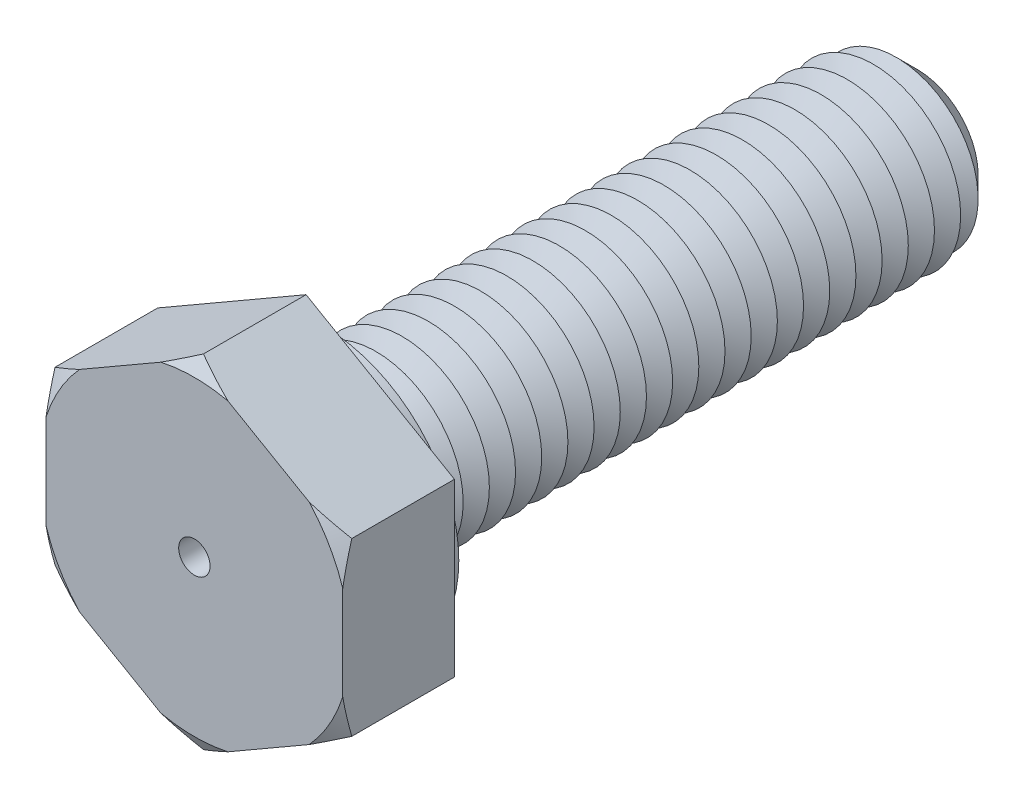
ISO-10303-21;
HEADER;
FILE_DESCRIPTION(('STEP AP214'),'2;1');
FILE_NAME('part.step','',(''),(''),'','','');
FILE_SCHEMA(('AUTOMOTIVE_DESIGN { 1 0 10303 214 1 1 1 1 }'));
ENDSEC;
DATA;
#1=APPLICATION_CONTEXT('core data for automotive mechanical design processes');
#2=APPLICATION_PROTOCOL_DEFINITION('international standard','automotive_design',2000,#1);
#3=PRODUCT_CONTEXT('',#1,'mechanical');
#4=PRODUCT('Part','Part','',(#3));
#5=PRODUCT_RELATED_PRODUCT_CATEGORY('part','',(#4));
#6=PRODUCT_DEFINITION_FORMATION('','',#4);
#7=PRODUCT_DEFINITION_CONTEXT('part definition',#1,'design');
#8=PRODUCT_DEFINITION('design','',#6,#7);
#9=PRODUCT_DEFINITION_SHAPE('','',#8);
#10=(LENGTH_UNIT() NAMED_UNIT(*) SI_UNIT(.MILLI.,.METRE.));
#11=(NAMED_UNIT(*) PLANE_ANGLE_UNIT() SI_UNIT($,.RADIAN.));
#12=(NAMED_UNIT(*) SI_UNIT($,.STERADIAN.) SOLID_ANGLE_UNIT());
#13=UNCERTAINTY_MEASURE_WITH_UNIT(LENGTH_MEASURE(1.E-05),#10,'distance_accuracy_value','');
#14=(GEOMETRIC_REPRESENTATION_CONTEXT(3) GLOBAL_UNCERTAINTY_ASSIGNED_CONTEXT((#13)) GLOBAL_UNIT_ASSIGNED_CONTEXT((#10,
#11,#12)) REPRESENTATION_CONTEXT('',''));
#15=CARTESIAN_POINT('',(0.,0.,0.));
#16=DIRECTION('',(0.,0.,1.));
#17=DIRECTION('',(1.,0.,0.));
#18=AXIS2_PLACEMENT_3D('',#15,#16,#17);
#19=CARTESIAN_POINT('',(8.5,4.90747728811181,6.4));
#20=DIRECTION('',(-0.5,-0.866025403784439,0.));
#21=DIRECTION('',(0.866025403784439,-0.5,0.));
#22=AXIS2_PLACEMENT_3D('',#19,#20,#21);
#23=PLANE('',#22);
#24=CARTESIAN_POINT('',(14.3974196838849,1.50260044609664,3.18954977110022));
#25=CARTESIAN_POINT('',(14.1303849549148,1.65677301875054,3.33361874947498));
#26=CARTESIAN_POINT('',(13.8627107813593,1.81131477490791,3.47613168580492));
#27=CARTESIAN_POINT('',(13.3258139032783,2.12129233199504,3.75731467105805));
#28=CARTESIAN_POINT('',(13.0565910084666,2.27672824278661,3.89598423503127));
#29=CARTESIAN_POINT('',(12.5155257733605,2.58911240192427,4.16915145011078));
#30=CARTESIAN_POINT('',(12.2436777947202,2.74606390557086,4.30363425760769));
#31=CARTESIAN_POINT('',(11.697943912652,3.06114350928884,4.56695627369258));
#32=CARTESIAN_POINT('',(11.4240580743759,3.21927157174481,4.69579566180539));
#33=CARTESIAN_POINT('',(10.8669438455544,3.54092162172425,4.94977636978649));
#34=CARTESIAN_POINT('',(10.5836547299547,3.70447866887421,5.07474091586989));
#35=CARTESIAN_POINT('',(10.0142178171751,4.03324322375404,5.31575754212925));
#36=CARTESIAN_POINT('',(9.72806988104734,4.19845081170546,5.43180918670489));
#37=CARTESIAN_POINT('',(9.15284957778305,4.53055440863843,5.6527883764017));
#38=CARTESIAN_POINT('',(8.86378033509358,4.69744861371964,5.75772666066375));
#39=CARTESIAN_POINT('',(8.28224800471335,5.03319646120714,5.95405449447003));
#40=CARTESIAN_POINT('',(7.98978536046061,5.20204984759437,6.04544579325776));
#41=CARTESIAN_POINT('',(7.29029341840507,5.60590170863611,6.24311258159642));
#42=CARTESIAN_POINT('',(6.88163396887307,5.84184135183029,6.34201308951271));
#43=CARTESIAN_POINT('',(6.2644717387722,6.1981601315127,6.46082851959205));
#44=CARTESIAN_POINT('',(6.05806549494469,6.31732883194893,6.49551015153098));
#45=CARTESIAN_POINT('',(5.64409758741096,6.55633331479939,6.55416143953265));
#46=CARTESIAN_POINT('',(5.43653593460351,6.67616909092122,6.57813119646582));
#47=CARTESIAN_POINT('',(5.02306823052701,6.914884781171,6.6144556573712));
#48=CARTESIAN_POINT('',(4.81717088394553,7.03375966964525,6.62694180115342));
#49=CARTESIAN_POINT('',(4.40509314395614,7.27167286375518,6.64040244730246));
#50=CARTESIAN_POINT('',(4.19891275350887,7.39071116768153,6.64137706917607));
#51=CARTESIAN_POINT('',(3.78675559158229,7.62867021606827,6.63178359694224));
#52=CARTESIAN_POINT('',(3.58077881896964,7.747590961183,6.62121556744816));
#53=CARTESIAN_POINT('',(3.16946579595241,7.9850626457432,6.58885652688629));
#54=CARTESIAN_POINT('',(2.96412965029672,8.10361352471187,6.56706376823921));
#55=CARTESIAN_POINT('',(2.47890311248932,8.38375919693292,6.50285520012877));
#56=CARTESIAN_POINT('',(2.19947000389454,8.54508997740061,6.45579627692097));
#57=CARTESIAN_POINT('',(1.6432817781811,8.86620539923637,6.34397240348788));
#58=CARTESIAN_POINT('',(1.36652705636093,9.02598981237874,6.27920487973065));
#59=CARTESIAN_POINT('',(0.815728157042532,9.34399370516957,6.13440902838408));
#60=CARTESIAN_POINT('',(0.541687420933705,9.50221119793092,6.05436342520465));
#61=CARTESIAN_POINT('',(-0.00331670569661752,9.81686947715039,5.88153285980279));
#62=CARTESIAN_POINT('',(-0.274280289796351,9.97331037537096,5.788748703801));
#63=CARTESIAN_POINT('',(-0.816522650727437,10.2863741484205,5.59147835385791));
#64=CARTESIAN_POINT('',(-1.08776675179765,10.4429770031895,5.48686595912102));
#65=CARTESIAN_POINT('',(-1.62738149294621,10.7545237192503,5.26886764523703));
#66=CARTESIAN_POINT('',(-1.89575390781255,10.9094686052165,5.15548754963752));
#67=CARTESIAN_POINT('',(-2.43005320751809,11.2179464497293,4.92150983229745));
#68=CARTESIAN_POINT('',(-2.69598059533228,11.3714796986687,4.80091373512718));
#69=CARTESIAN_POINT('',(-3.22575115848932,11.6773428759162,4.55376737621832));
#70=CARTESIAN_POINT('',(-3.48959429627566,11.829672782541,4.42721700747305));
#71=CARTESIAN_POINT('',(-3.9337259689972,12.0860923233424,4.20929972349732));
#72=CARTESIAN_POINT('',(-4.11449197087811,12.1904576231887,4.11922480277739));
#73=CARTESIAN_POINT('',(-4.47523725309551,12.3987340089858,3.93701701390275));
#74=CARTESIAN_POINT('',(-4.6552165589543,12.5026451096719,3.84488421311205));
#75=CARTESIAN_POINT('',(-5.01258669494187,12.7089728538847,3.65977671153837));
#76=CARTESIAN_POINT('',(-5.18998489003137,12.8113937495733,3.56682094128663));
#77=CARTESIAN_POINT('',(-5.54415606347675,13.0158745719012,3.3793246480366));
#78=CARTESIAN_POINT('',(-5.72092903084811,13.1179344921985,3.28478409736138));
#79=CARTESIAN_POINT('',(-5.89741968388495,13.2198314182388,3.18954977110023));
#80=B_SPLINE_CURVE_WITH_KNOTS('',3,(#24,#25,#26,#27,#28,#29,#30,#31,#32,#33,#34,#35,#36,#37,#38,
#39,#40,#41,#42,#43,#44,#45,#46,#47,#48,#49,#50,#51,#52,#53,#54,#55,#56,#57,#58,#59,#60,#61,#62,
#63,#64,#65,#66,#67,#68,#69,#70,#71,#72,#73,#74,#75,#76,#77,#78,#79),.UNSPECIFIED.,.F.,.F.,(4,2,
2,2,2,2,2,2,2,2,2,2,2,2,2,2,2,2,2,2,2,2,2,2,2,2,2,4),(0.,1.02103660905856,2.04220146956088,
3.06664888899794,4.09106369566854,5.1414707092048,6.19192902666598,7.24136281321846,
8.29066097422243,9.73548564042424,10.45782862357,11.1801648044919,11.8941264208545,
12.6080806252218,13.3220308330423,14.036092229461,15.0137259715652,15.9915018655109,
16.9703899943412,17.9492161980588,18.939699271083,19.9295300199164,20.9191523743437,
21.9087925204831,22.5907917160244,23.272768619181,23.947601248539,24.622445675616),.UNSPECIFIED.);
#81=CARTESIAN_POINT('',(8.5,4.90747728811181,5.88038475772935));
#82=VERTEX_POINT('',#81);
#83=CARTESIAN_POINT('',(6.57804882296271,6.01711631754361,6.4));
#84=VERTEX_POINT('',#83);
#85=EDGE_CURVE('E132',#82,#84,#80,.T.);
#86=ORIENTED_EDGE('',*,*,#85,.F.);
#87=DIRECTION('',(0.,0.,-1.));
#88=VECTOR('',#87,1.);
#89=CARTESIAN_POINT('',(8.5,4.90747728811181,6.4));
#90=LINE('',#89,#88);
#91=CARTESIAN_POINT('',(8.5,4.90747728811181,0.));
#92=VERTEX_POINT('',#91);
#93=EDGE_CURVE('E144',#82,#92,#90,.T.);
#94=ORIENTED_EDGE('',*,*,#93,.T.);
#95=DIRECTION('',(-0.866025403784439,0.5,0.));
#96=VECTOR('',#95,1.);
#97=CARTESIAN_POINT('',(8.5,4.90747728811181,0.));
#98=LINE('',#97,#96);
#99=CARTESIAN_POINT('',(0.,9.81495457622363,0.));
#100=VERTEX_POINT('',#99);
#101=EDGE_CURVE('E377',#92,#100,#98,.T.);
#102=ORIENTED_EDGE('',*,*,#101,.T.);
#103=DIRECTION('',(0.,0.,-1.));
#104=VECTOR('',#103,1.);
#105=CARTESIAN_POINT('',(0.,9.81495457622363,6.4));
#106=LINE('',#105,#104);
#107=CARTESIAN_POINT('',(0.,9.81495457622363,5.88038475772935));
#108=VERTEX_POINT('',#107);
#109=EDGE_CURVE('E178',#108,#100,#106,.T.);
#110=ORIENTED_EDGE('',*,*,#109,.F.);
#111=CARTESIAN_POINT('',(1.92195117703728,8.70531554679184,6.4));
#112=VERTEX_POINT('',#111);
#113=EDGE_CURVE('E151',#112,#108,#80,.T.);
#114=ORIENTED_EDGE('',*,*,#113,.F.);
#115=DIRECTION('',(-0.866025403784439,0.5,0.));
#116=VECTOR('',#115,1.);
#117=CARTESIAN_POINT('',(8.5,4.90747728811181,6.4));
#118=LINE('',#117,#116);
#119=EDGE_CURVE('E148',#84,#112,#118,.T.);
#120=ORIENTED_EDGE('',*,*,#119,.F.);
#121=EDGE_LOOP('',(#86,#94,#102,#110,#114,#120));
#122=FACE_BOUND('',#121,.T.);
#123=ADVANCED_FACE('F39',(#122),#23,.F.);
#124=CARTESIAN_POINT('',(0.,9.81495457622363,6.4));
#125=DIRECTION('',(0.5,-0.866025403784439,0.));
#126=DIRECTION('',(0.866025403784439,0.5,0.));
#127=AXIS2_PLACEMENT_3D('',#124,#125,#126);
#128=PLANE('',#127);
#129=CARTESIAN_POINT('',(5.89741968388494,13.2198314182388,3.18954977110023));
#130=CARTESIAN_POINT('',(5.63038495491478,13.0656588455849,3.33361874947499));
#131=CARTESIAN_POINT('',(5.36271078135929,12.9111170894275,3.47613168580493));
#132=CARTESIAN_POINT('',(4.82581390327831,12.6011395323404,3.75731467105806));
#133=CARTESIAN_POINT('',(4.55659100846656,12.4457036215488,3.89598423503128));
#134=CARTESIAN_POINT('',(4.01552577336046,12.1333194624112,4.16915145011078));
#135=CARTESIAN_POINT('',(3.74367779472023,11.9763679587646,4.30363425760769));
#136=CARTESIAN_POINT('',(3.19794391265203,11.6612883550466,4.56695627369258));
#137=CARTESIAN_POINT('',(2.92405807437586,11.5031602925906,4.69579566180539));
#138=CARTESIAN_POINT('',(2.3669438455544,11.1815102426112,4.9497763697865));
#139=CARTESIAN_POINT('',(2.08365472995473,11.0179531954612,5.0747409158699));
#140=CARTESIAN_POINT('',(1.51421781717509,10.6891886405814,5.31575754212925));
#141=CARTESIAN_POINT('',(1.22806988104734,10.52398105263,5.4318091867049));
#142=CARTESIAN_POINT('',(0.652849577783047,10.191877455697,5.6527883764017));
#143=CARTESIAN_POINT('',(0.363780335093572,10.0249832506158,5.75772666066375));
#144=CARTESIAN_POINT('',(-0.21775199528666,9.6892354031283,5.95405449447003));
#145=CARTESIAN_POINT('',(-0.510214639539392,9.52038201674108,6.04544579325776));
#146=CARTESIAN_POINT('',(-1.20970658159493,9.11653015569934,6.24311258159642));
#147=CARTESIAN_POINT('',(-1.61836603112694,8.88059051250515,6.34201308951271));
#148=CARTESIAN_POINT('',(-2.2355282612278,8.52427173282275,6.46082851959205));
#149=CARTESIAN_POINT('',(-2.44193450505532,8.40510303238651,6.49551015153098));
#150=CARTESIAN_POINT('',(-2.85590241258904,8.16609854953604,6.55416143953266));
#151=CARTESIAN_POINT('',(-3.0634640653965,8.04626277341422,6.57813119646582));
#152=CARTESIAN_POINT('',(-3.47693176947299,7.80754708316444,6.6144556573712));
#153=CARTESIAN_POINT('',(-3.68282911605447,7.68867219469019,6.62694180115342));
#154=CARTESIAN_POINT('',(-4.09490685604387,7.45075900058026,6.64040244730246));
#155=CARTESIAN_POINT('',(-4.30108724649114,7.33172069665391,6.64137706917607));
#156=CARTESIAN_POINT('',(-4.71324440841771,7.09376164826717,6.63178359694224));
#157=CARTESIAN_POINT('',(-4.91922118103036,6.97484090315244,6.62121556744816));
#158=CARTESIAN_POINT('',(-5.3305342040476,6.73736921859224,6.58885652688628));
#159=CARTESIAN_POINT('',(-5.53587034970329,6.61881833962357,6.5670637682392));
#160=CARTESIAN_POINT('',(-6.02109688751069,6.33867266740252,6.50285520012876));
#161=CARTESIAN_POINT('',(-6.30052999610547,6.17734188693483,6.45579627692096));
#162=CARTESIAN_POINT('',(-6.85671822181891,5.85622646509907,6.34397240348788));
#163=CARTESIAN_POINT('',(-7.13347294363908,5.6964420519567,6.27920487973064));
#164=CARTESIAN_POINT('',(-7.68427184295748,5.37843815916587,6.13440902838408));
#165=CARTESIAN_POINT('',(-7.9583125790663,5.22022066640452,6.05436342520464));
#166=CARTESIAN_POINT('',(-8.50331670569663,4.90556238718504,5.88153285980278));
#167=CARTESIAN_POINT('',(-8.77428028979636,4.74912148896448,5.78874870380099));
#168=CARTESIAN_POINT('',(-9.31652265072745,4.4360577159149,5.59147835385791));
#169=CARTESIAN_POINT('',(-9.58776675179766,4.27945486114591,5.48686595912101));
#170=CARTESIAN_POINT('',(-10.1273814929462,3.9679081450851,5.26886764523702));
#171=CARTESIAN_POINT('',(-10.3957539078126,3.81296325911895,5.15548754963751));
#172=CARTESIAN_POINT('',(-10.9300532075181,3.50448541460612,4.92150983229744));
#173=CARTESIAN_POINT('',(-11.1959805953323,3.35095216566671,4.80091373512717));
#174=CARTESIAN_POINT('',(-11.7257511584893,3.04508898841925,4.55376737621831));
#175=CARTESIAN_POINT('',(-11.9895942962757,2.89275908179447,4.42721700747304));
#176=CARTESIAN_POINT('',(-12.4337259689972,2.63633954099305,4.20929972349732));
#177=CARTESIAN_POINT('',(-12.6144919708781,2.53197424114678,4.11922480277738));
#178=CARTESIAN_POINT('',(-12.9752372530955,2.32369785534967,3.93701701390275));
#179=CARTESIAN_POINT('',(-13.1552165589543,2.21978675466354,3.84488421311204));
#180=CARTESIAN_POINT('',(-13.5125866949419,2.01345901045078,3.65977671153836));
#181=CARTESIAN_POINT('',(-13.6899848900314,1.91103811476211,3.56682094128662));
#182=CARTESIAN_POINT('',(-14.0441560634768,1.70655729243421,3.37932464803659));
#183=CARTESIAN_POINT('',(-14.2209290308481,1.60449737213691,3.28478409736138));
#184=CARTESIAN_POINT('',(-14.3974196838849,1.50260044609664,3.18954977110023));
#185=B_SPLINE_CURVE_WITH_KNOTS('',3,(#129,#130,#131,#132,#133,#134,#135,#136,#137,#138,#139,
#140,#141,#142,#143,#144,#145,#146,#147,#148,#149,#150,#151,#152,#153,#154,#155,#156,#157,#158,
#159,#160,#161,#162,#163,#164,#165,#166,#167,#168,#169,#170,#171,#172,#173,#174,#175,#176,#177,
#178,#179,#180,#181,#182,#183,#184),.UNSPECIFIED.,.F.,.F.,(4,2,2,2,2,2,2,2,2,2,2,2,2,2,2,2,2,2,
2,2,2,2,2,2,2,2,2,4),(0.,1.02103660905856,2.04220146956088,3.06664888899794,4.09106369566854,
5.14147070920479,6.19192902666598,7.24136281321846,8.29066097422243,9.73548564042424,
10.45782862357,11.1801648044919,11.8941264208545,12.6080806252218,13.3220308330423,
14.036092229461,15.0137259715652,15.991501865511,16.9703899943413,17.9492161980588,
18.939699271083,19.9295300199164,20.9191523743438,21.9087925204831,22.5907917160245,
23.272768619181,23.947601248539,24.622445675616),.UNSPECIFIED.);
#186=CARTESIAN_POINT('',(-1.92195117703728,8.70531554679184,6.4));
#187=VERTEX_POINT('',#186);
#188=EDGE_CURVE('E428',#108,#187,#185,.T.);
#189=ORIENTED_EDGE('',*,*,#188,.F.);
#190=ORIENTED_EDGE('',*,*,#109,.T.);
#191=DIRECTION('',(-0.866025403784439,-0.5,0.));
#192=VECTOR('',#191,1.);
#193=CARTESIAN_POINT('',(0.,9.81495457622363,0.));
#194=LINE('',#193,#192);
#195=CARTESIAN_POINT('',(-8.5,4.90747728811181,0.));
#196=VERTEX_POINT('',#195);
#197=EDGE_CURVE('E396',#100,#196,#194,.T.);
#198=ORIENTED_EDGE('',*,*,#197,.T.);
#199=DIRECTION('',(0.,0.,-1.));
#200=VECTOR('',#199,1.);
#201=CARTESIAN_POINT('',(-8.5,4.90747728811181,6.4));
#202=LINE('',#201,#200);
#203=CARTESIAN_POINT('',(-8.5,4.90747728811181,5.88038475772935));
#204=VERTEX_POINT('',#203);
#205=EDGE_CURVE('E175',#204,#196,#202,.T.);
#206=ORIENTED_EDGE('',*,*,#205,.F.);
#207=CARTESIAN_POINT('',(-6.57804882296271,6.01711631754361,6.4));
#208=VERTEX_POINT('',#207);
#209=EDGE_CURVE('E432',#208,#204,#185,.T.);
#210=ORIENTED_EDGE('',*,*,#209,.F.);
#211=DIRECTION('',(-0.866025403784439,-0.5,0.));
#212=VECTOR('',#211,1.);
#213=CARTESIAN_POINT('',(0.,9.81495457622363,6.4));
#214=LINE('',#213,#212);
#215=EDGE_CURVE('E380',#187,#208,#214,.T.);
#216=ORIENTED_EDGE('',*,*,#215,.F.);
#217=EDGE_LOOP('',(#189,#190,#198,#206,#210,#216));
#218=FACE_BOUND('',#217,.T.);
#219=ADVANCED_FACE('F425',(#218),#128,.F.);
#220=CARTESIAN_POINT('',(-8.5,4.90747728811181,6.4));
#221=DIRECTION('',(1.,0.,0.));
#222=DIRECTION('',(0.,0.,-1.));
#223=AXIS2_PLACEMENT_3D('',#220,#221,#222);
#224=PLANE('',#223);
#225=CARTESIAN_POINT('',(-8.5,10.8048969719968,3.60988571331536));
#226=CARTESIAN_POINT('',(-8.5,10.4978348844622,3.74918346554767));
#227=CARTESIAN_POINT('',(-8.5,10.189932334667,3.88666386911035));
#228=CARTESIAN_POINT('',(-8.5,9.57208629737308,4.15710808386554));
#229=CARTESIAN_POINT('',(-8.5,9.26214245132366,4.29007107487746));
#230=CARTESIAN_POINT('',(-8.5,8.6386633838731,4.55109231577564));
#231=CARTESIAN_POINT('',(-8.5,8.32511856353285,4.67912772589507));
#232=CARTESIAN_POINT('',(-8.5,7.69537699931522,4.92848462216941));
#233=CARTESIAN_POINT('',(-8.5,7.37918037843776,5.04980641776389));
#234=CARTESIAN_POINT('',(-8.5,6.74517674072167,5.28371307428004));
#235=CARTESIAN_POINT('',(-8.5,6.42738342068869,5.39633487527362));
#236=CARTESIAN_POINT('',(-8.5,5.78839893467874,5.61161420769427));
#237=CARTESIAN_POINT('',(-8.5,5.46720760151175,5.7142712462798));
#238=CARTESIAN_POINT('',(-8.5,4.82159629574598,5.90726308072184));
#239=CARTESIAN_POINT('',(-8.5,4.49718135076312,5.99761456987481));
#240=CARTESIAN_POINT('',(-8.5,3.84456693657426,6.16359045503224));
#241=CARTESIAN_POINT('',(-8.5,3.51636763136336,6.23921548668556));
#242=CARTESIAN_POINT('',(-8.5,2.94974096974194,6.35404738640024));
#243=CARTESIAN_POINT('',(-8.5,2.7121746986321,6.39750509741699));
#244=CARTESIAN_POINT('',(-8.5,2.23545236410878,6.47441576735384));
#245=CARTESIAN_POINT('',(-8.5,1.99629657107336,6.50787038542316));
#246=CARTESIAN_POINT('',(-8.5,1.51674855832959,6.56389930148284));
#247=CARTESIAN_POINT('',(-8.5,1.27635657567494,6.58647561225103));
#248=CARTESIAN_POINT('',(-8.5,0.794760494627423,6.62010098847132));
#249=CARTESIAN_POINT('',(-8.5,0.553556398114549,6.63115008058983));
#250=CARTESIAN_POINT('',(-8.5,0.0710159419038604,6.64137634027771));
#251=CARTESIAN_POINT('',(-8.5,-0.170320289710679,6.64055949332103));
#252=CARTESIAN_POINT('',(-8.5,-0.65265778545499,6.62709447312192));
#253=CARTESIAN_POINT('',(-8.5,-0.893659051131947,6.6144463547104));
#254=CARTESIAN_POINT('',(-8.5,-1.37480632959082,6.57770491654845));
#255=CARTESIAN_POINT('',(-8.5,-1.61495224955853,6.55361039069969));
#256=CARTESIAN_POINT('',(-8.5,-2.09391419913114,6.49466927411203));
#257=CARTESIAN_POINT('',(-8.5,-2.33273017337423,6.4598222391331));
#258=CARTESIAN_POINT('',(-8.5,-2.92716537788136,6.36046793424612));
#259=CARTESIAN_POINT('',(-8.5,-3.28176466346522,6.28983043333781));
#260=CARTESIAN_POINT('',(-8.5,-3.98672843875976,6.12983266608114));
#261=CARTESIAN_POINT('',(-8.5,-4.3370917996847,6.0404675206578));
#262=CARTESIAN_POINT('',(-8.5,-5.0342542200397,5.84616571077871));
#263=CARTESIAN_POINT('',(-8.5,-5.3810438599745,5.74119557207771));
#264=CARTESIAN_POINT('',(-8.5,-6.07054103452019,5.51879279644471));
#265=CARTESIAN_POINT('',(-8.5,-6.41324885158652,5.40136102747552));
#266=CARTESIAN_POINT('',(-8.5,-7.09891821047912,5.15508322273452));
#267=CARTESIAN_POINT('',(-8.5,-7.44183833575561,5.02612259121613));
#268=CARTESIAN_POINT('',(-8.5,-8.12447486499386,4.75996128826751));
#269=CARTESIAN_POINT('',(-8.5,-8.46419106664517,4.62276010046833));
#270=CARTESIAN_POINT('',(-8.5,-9.13876623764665,4.34260011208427));
#271=CARTESIAN_POINT('',(-8.5,-9.47364225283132,4.19968216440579));
#272=CARTESIAN_POINT('',(-8.5,-10.1409696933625,3.90850505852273));
#273=CARTESIAN_POINT('',(-8.5,-10.4734216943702,3.76024722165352));
#274=CARTESIAN_POINT('',(-8.5,-10.8048969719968,3.60988571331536));
#275=B_SPLINE_CURVE_WITH_KNOTS('',3,(#225,#226,#227,#228,#229,#230,#231,#232,#233,#234,#235,
#236,#237,#238,#239,#240,#241,#242,#243,#244,#245,#246,#247,#248,#249,#250,#251,#252,#253,#254,
#255,#256,#257,#258,#259,#260,#261,#262,#263,#264,#265,#266,#267,#268,#269,#270,#271,#272,#273,
#274),.UNSPECIFIED.,.F.,.F.,(4,2,2,2,2,2,2,2,2,2,2,2,2,2,2,2,2,2,2,2,2,2,2,2,4),(0.,
1.01155870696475,2.02330010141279,3.03927305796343,4.05519914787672,5.06654285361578,
6.07793655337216,7.08794426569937,8.09790837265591,8.82224854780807,9.5464685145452,
10.2705544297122,10.9946386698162,11.7183576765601,12.4420733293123,13.1658652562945,
13.8896870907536,14.9737367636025,16.0580692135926,17.1447621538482,18.2313794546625,
19.3303511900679,20.4293918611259,21.5216359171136,22.6136115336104),.UNSPECIFIED.);
#276=CARTESIAN_POINT('',(-8.5,2.68819922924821,6.4));
#277=VERTEX_POINT('',#276);
#278=EDGE_CURVE('E435',#204,#277,#275,.T.);
#279=ORIENTED_EDGE('',*,*,#278,.F.);
#280=ORIENTED_EDGE('',*,*,#205,.T.);
#281=DIRECTION('',(0.,-1.,0.));
#282=VECTOR('',#281,1.);
#283=CARTESIAN_POINT('',(-8.5,4.90747728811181,0.));
#284=LINE('',#283,#282);
#285=CARTESIAN_POINT('',(-8.5,-4.90747728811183,0.));
#286=VERTEX_POINT('',#285);
#287=EDGE_CURVE('E400',#196,#286,#284,.T.);
#288=ORIENTED_EDGE('',*,*,#287,.T.);
#289=DIRECTION('',(0.,0.,-1.));
#290=VECTOR('',#289,1.);
#291=CARTESIAN_POINT('',(-8.5,-4.90747728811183,6.4));
#292=LINE('',#291,#290);
#293=CARTESIAN_POINT('',(-8.49999999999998,-4.90747728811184,5.88038475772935));
#294=VERTEX_POINT('',#293);
#295=EDGE_CURVE('E172',#294,#286,#292,.T.);
#296=ORIENTED_EDGE('',*,*,#295,.F.);
#297=CARTESIAN_POINT('',(-8.5,-2.68819922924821,6.4));
#298=VERTEX_POINT('',#297);
#299=EDGE_CURVE('E442',#298,#294,#275,.T.);
#300=ORIENTED_EDGE('',*,*,#299,.F.);
#301=DIRECTION('',(0.,-1.,0.));
#302=VECTOR('',#301,1.);
#303=CARTESIAN_POINT('',(-8.5,4.90747728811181,6.4));
#304=LINE('',#303,#302);
#305=EDGE_CURVE('E384',#277,#298,#304,.T.);
#306=ORIENTED_EDGE('',*,*,#305,.F.);
#307=EDGE_LOOP('',(#279,#280,#288,#296,#300,#306));
#308=FACE_BOUND('',#307,.T.);
#309=ADVANCED_FACE('F487',(#308),#224,.F.);
#310=CARTESIAN_POINT('',(-8.5,-4.90747728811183,6.4));
#311=DIRECTION('',(0.5,0.866025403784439,0.));
#312=DIRECTION('',(-0.866025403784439,0.5,0.));
#313=AXIS2_PLACEMENT_3D('',#310,#311,#312);
#314=PLANE('',#313);
#315=CARTESIAN_POINT('',(-14.3974196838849,-1.50260044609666,3.18954977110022));
#316=CARTESIAN_POINT('',(-14.1303849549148,-1.65677301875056,3.33361874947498));
#317=CARTESIAN_POINT('',(-13.8627107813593,-1.81131477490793,3.47613168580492));
#318=CARTESIAN_POINT('',(-13.3258139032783,-2.12129233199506,3.75731467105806));
#319=CARTESIAN_POINT('',(-13.0565910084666,-2.27672824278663,3.89598423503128));
#320=CARTESIAN_POINT('',(-12.5155257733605,-2.58911240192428,4.16915145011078));
#321=CARTESIAN_POINT('',(-12.2436777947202,-2.74606390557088,4.30363425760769));
#322=CARTESIAN_POINT('',(-11.697943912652,-3.06114350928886,4.56695627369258));
#323=CARTESIAN_POINT('',(-11.4240580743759,-3.21927157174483,4.69579566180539));
#324=CARTESIAN_POINT('',(-10.8669438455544,-3.54092162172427,4.94977636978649));
#325=CARTESIAN_POINT('',(-10.5836547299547,-3.70447866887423,5.07474091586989));
#326=CARTESIAN_POINT('',(-10.0142178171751,-4.03324322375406,5.31575754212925));
#327=CARTESIAN_POINT('',(-9.72806988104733,-4.19845081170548,5.43180918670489));
#328=CARTESIAN_POINT('',(-9.15284957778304,-4.53055440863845,5.65278837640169));
#329=CARTESIAN_POINT('',(-8.86378033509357,-4.69744861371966,5.75772666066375));
#330=CARTESIAN_POINT('',(-8.28224800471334,-5.03319646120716,5.95405449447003));
#331=CARTESIAN_POINT('',(-7.9897853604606,-5.20204984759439,6.04544579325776));
#332=CARTESIAN_POINT('',(-7.29029341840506,-5.60590170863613,6.24311258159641));
#333=CARTESIAN_POINT('',(-6.88163396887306,-5.84184135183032,6.34201308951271));
#334=CARTESIAN_POINT('',(-6.26447173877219,-6.19816013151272,6.46082851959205));
#335=CARTESIAN_POINT('',(-6.05806549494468,-6.31732883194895,6.49551015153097));
#336=CARTESIAN_POINT('',(-5.64409758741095,-6.55633331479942,6.55416143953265));
#337=CARTESIAN_POINT('',(-5.4365359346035,-6.67616909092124,6.57813119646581));
#338=CARTESIAN_POINT('',(-5.023068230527,-6.91488478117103,6.6144556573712));
#339=CARTESIAN_POINT('',(-4.81717088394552,-7.03375966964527,6.62694180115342));
#340=CARTESIAN_POINT('',(-4.40509314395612,-7.2716728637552,6.64040244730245));
#341=CARTESIAN_POINT('',(-4.19891275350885,-7.39071116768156,6.64137706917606));
#342=CARTESIAN_POINT('',(-3.78675559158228,-7.6286702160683,6.63178359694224));
#343=CARTESIAN_POINT('',(-3.58077881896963,-7.74759096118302,6.62121556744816));
#344=CARTESIAN_POINT('',(-3.16946579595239,-7.98506264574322,6.58885652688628));
#345=CARTESIAN_POINT('',(-2.9641296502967,-8.10361352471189,6.5670637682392));
#346=CARTESIAN_POINT('',(-2.4789031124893,-8.38375919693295,6.50285520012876));
#347=CARTESIAN_POINT('',(-2.19947000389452,-8.54508997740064,6.45579627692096));
#348=CARTESIAN_POINT('',(-1.64328177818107,-8.8662053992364,6.34397240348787));
#349=CARTESIAN_POINT('',(-1.36652705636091,-9.02598981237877,6.27920487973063));
#350=CARTESIAN_POINT('',(-0.815728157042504,-9.3439937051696,6.13440902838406));
#351=CARTESIAN_POINT('',(-0.541687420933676,-9.50221119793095,6.05436342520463));
#352=CARTESIAN_POINT('',(0.00331670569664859,-9.81686947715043,5.88153285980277));
#353=CARTESIAN_POINT('',(0.274280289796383,-9.973310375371,5.78874870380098));
#354=CARTESIAN_POINT('',(0.81652265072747,-10.2863741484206,5.59147835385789));
#355=CARTESIAN_POINT('',(1.08776675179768,-10.4429770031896,5.486865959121));
#356=CARTESIAN_POINT('',(1.62738149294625,-10.7545237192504,5.268867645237));
#357=CARTESIAN_POINT('',(1.89575390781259,-10.9094686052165,5.15548754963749));
#358=CARTESIAN_POINT('',(2.43005320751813,-11.2179464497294,4.92150983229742));
#359=CARTESIAN_POINT('',(2.69598059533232,-11.3714796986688,4.80091373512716));
#360=CARTESIAN_POINT('',(3.22575115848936,-11.6773428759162,4.55376737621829));
#361=CARTESIAN_POINT('',(3.48959429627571,-11.829672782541,4.42721700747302));
#362=CARTESIAN_POINT('',(3.93372596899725,-12.0860923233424,4.20929972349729));
#363=CARTESIAN_POINT('',(4.11449197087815,-12.1904576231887,4.11922480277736));
#364=CARTESIAN_POINT('',(4.47523725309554,-12.3987340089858,3.93701701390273));
#365=CARTESIAN_POINT('',(4.65521655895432,-12.5026451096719,3.84488421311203));
#366=CARTESIAN_POINT('',(5.01258669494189,-12.7089728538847,3.65977671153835));
#367=CARTESIAN_POINT('',(5.18998489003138,-12.8113937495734,3.56682094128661));
#368=CARTESIAN_POINT('',(5.54415606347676,-13.0158745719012,3.37932464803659));
#369=CARTESIAN_POINT('',(5.72092903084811,-13.1179344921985,3.28478409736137));
#370=CARTESIAN_POINT('',(5.89741968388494,-13.2198314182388,3.18954977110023));
#371=B_SPLINE_CURVE_WITH_KNOTS('',3,(#315,#316,#317,#318,#319,#320,#321,#322,#323,#324,#325,
#326,#327,#328,#329,#330,#331,#332,#333,#334,#335,#336,#337,#338,#339,#340,#341,#342,#343,#344,
#345,#346,#347,#348,#349,#350,#351,#352,#353,#354,#355,#356,#357,#358,#359,#360,#361,#362,#363,
#364,#365,#366,#367,#368,#369,#370),.UNSPECIFIED.,.F.,.F.,(4,2,2,2,2,2,2,2,2,2,2,2,2,2,2,2,2,2,
2,2,2,2,2,2,2,2,2,4),(0.,1.02103660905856,2.04220146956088,3.06664888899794,4.09106369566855,
5.1414707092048,6.19192902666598,7.24136281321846,8.29066097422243,9.73548564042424,
10.45782862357,11.1801648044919,11.8941264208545,12.6080806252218,13.3220308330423,
14.036092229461,15.0137259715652,15.991501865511,16.9703899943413,17.9492161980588,
18.939699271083,19.9295300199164,20.9191523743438,21.9087925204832,22.5907917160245,
23.272768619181,23.947601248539,24.622445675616),.UNSPECIFIED.);
#372=CARTESIAN_POINT('',(-6.57804882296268,-6.01711631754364,6.4));
#373=VERTEX_POINT('',#372);
#374=EDGE_CURVE('E483',#294,#373,#371,.T.);
#375=ORIENTED_EDGE('',*,*,#374,.F.);
#376=ORIENTED_EDGE('',*,*,#295,.T.);
#377=DIRECTION('',(0.866025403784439,-0.5,0.));
#378=VECTOR('',#377,1.);
#379=CARTESIAN_POINT('',(-8.5,-4.90747728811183,0.));
#380=LINE('',#379,#378);
#381=CARTESIAN_POINT('',(0.,-9.81495457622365,0.));
#382=VERTEX_POINT('',#381);
#383=EDGE_CURVE('E404',#286,#382,#380,.T.);
#384=ORIENTED_EDGE('',*,*,#383,.T.);
#385=DIRECTION('',(0.,0.,-1.));
#386=VECTOR('',#385,1.);
#387=CARTESIAN_POINT('',(0.,-9.81495457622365,6.4));
#388=LINE('',#387,#386);
#389=CARTESIAN_POINT('',(0.,-9.81495457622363,5.88038475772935));
#390=VERTEX_POINT('',#389);
#391=EDGE_CURVE('E163',#390,#382,#388,.T.);
#392=ORIENTED_EDGE('',*,*,#391,.F.);
#393=CARTESIAN_POINT('',(-1.92195117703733,-8.70531554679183,6.4));
#394=VERTEX_POINT('',#393);
#395=EDGE_CURVE('E477',#394,#390,#371,.T.);
#396=ORIENTED_EDGE('',*,*,#395,.F.);
#397=DIRECTION('',(0.866025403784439,-0.5,0.));
#398=VECTOR('',#397,1.);
#399=CARTESIAN_POINT('',(-8.5,-4.90747728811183,6.4));
#400=LINE('',#399,#398);
#401=EDGE_CURVE('E388',#373,#394,#400,.T.);
#402=ORIENTED_EDGE('',*,*,#401,.F.);
#403=EDGE_LOOP('',(#375,#376,#384,#392,#396,#402));
#404=FACE_BOUND('',#403,.T.);
#405=ADVANCED_FACE('F484',(#404),#314,.F.);
#406=CARTESIAN_POINT('',(0.,-9.81495457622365,6.4));
#407=DIRECTION('',(-0.5,0.866025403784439,0.));
#408=DIRECTION('',(-0.866025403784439,-0.5,0.));
#409=AXIS2_PLACEMENT_3D('',#406,#407,#408);
#410=PLANE('',#409);
#411=CARTESIAN_POINT('',(-5.89741968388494,-13.2198314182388,3.18954977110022));
#412=CARTESIAN_POINT('',(-5.63038495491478,-13.0656588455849,3.33361874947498));
#413=CARTESIAN_POINT('',(-5.36271078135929,-12.9111170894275,3.47613168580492));
#414=CARTESIAN_POINT('',(-4.8258139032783,-12.6011395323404,3.75731467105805));
#415=CARTESIAN_POINT('',(-4.55659100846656,-12.4457036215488,3.89598423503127));
#416=CARTESIAN_POINT('',(-4.01552577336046,-12.1333194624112,4.16915145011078));
#417=CARTESIAN_POINT('',(-3.74367779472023,-11.9763679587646,4.30363425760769));
#418=CARTESIAN_POINT('',(-3.19794391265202,-11.6612883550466,4.56695627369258));
#419=CARTESIAN_POINT('',(-2.92405807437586,-11.5031602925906,4.69579566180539));
#420=CARTESIAN_POINT('',(-2.36694384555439,-11.1815102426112,4.94977636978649));
#421=CARTESIAN_POINT('',(-2.08365472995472,-11.0179531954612,5.07474091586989));
#422=CARTESIAN_POINT('',(-1.51421781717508,-10.6891886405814,5.31575754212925));
#423=CARTESIAN_POINT('',(-1.22806988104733,-10.52398105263,5.43180918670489));
#424=CARTESIAN_POINT('',(-0.652849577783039,-10.191877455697,5.65278837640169));
#425=CARTESIAN_POINT('',(-0.363780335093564,-10.0249832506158,5.75772666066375));
#426=CARTESIAN_POINT('',(0.217751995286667,-9.68923540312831,5.95405449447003));
#427=CARTESIAN_POINT('',(0.5102146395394,-9.52038201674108,6.04544579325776));
#428=CARTESIAN_POINT('',(1.20970658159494,-9.11653015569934,6.24311258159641));
#429=CARTESIAN_POINT('',(1.61836603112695,-8.88059051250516,6.34201308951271));
#430=CARTESIAN_POINT('',(2.23552826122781,-8.52427173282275,6.46082851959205));
#431=CARTESIAN_POINT('',(2.44193450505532,-8.40510303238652,6.49551015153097));
#432=CARTESIAN_POINT('',(2.85590241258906,-8.16609854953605,6.55416143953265));
#433=CARTESIAN_POINT('',(3.06346406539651,-8.04626277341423,6.57813119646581));
#434=CARTESIAN_POINT('',(3.47693176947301,-7.80754708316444,6.61445565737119));
#435=CARTESIAN_POINT('',(3.68282911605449,-7.6886721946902,6.62694180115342));
#436=CARTESIAN_POINT('',(4.09490685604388,-7.45075900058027,6.64040244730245));
#437=CARTESIAN_POINT('',(4.30108724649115,-7.33172069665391,6.64137706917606));
#438=CARTESIAN_POINT('',(4.71324440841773,-7.09376164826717,6.63178359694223));
#439=CARTESIAN_POINT('',(4.91922118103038,-6.97484090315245,6.62121556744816));
#440=CARTESIAN_POINT('',(5.33053420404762,-6.73736921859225,6.58885652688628));
#441=CARTESIAN_POINT('',(5.5358703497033,-6.61881833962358,6.5670637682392));
#442=CARTESIAN_POINT('',(6.02109688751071,-6.33867266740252,6.50285520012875));
#443=CARTESIAN_POINT('',(6.30052999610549,-6.17734188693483,6.45579627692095));
#444=CARTESIAN_POINT('',(6.85671822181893,-5.85622646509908,6.34397240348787));
#445=CARTESIAN_POINT('',(7.1334729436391,-5.6964420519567,6.27920487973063));
#446=CARTESIAN_POINT('',(7.6842718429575,-5.37843815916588,6.13440902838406));
#447=CARTESIAN_POINT('',(7.95831257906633,-5.22022066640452,6.05436342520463));
#448=CARTESIAN_POINT('',(8.50331670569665,-4.90556238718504,5.88153285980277));
#449=CARTESIAN_POINT('',(8.77428028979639,-4.74912148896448,5.78874870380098));
#450=CARTESIAN_POINT('',(9.31652265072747,-4.4360577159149,5.59147835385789));
#451=CARTESIAN_POINT('',(9.58776675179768,-4.27945486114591,5.486865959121));
#452=CARTESIAN_POINT('',(10.1273814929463,-3.9679081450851,5.268867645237));
#453=CARTESIAN_POINT('',(10.3957539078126,-3.81296325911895,5.15548754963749));
#454=CARTESIAN_POINT('',(10.9300532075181,-3.50448541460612,4.92150983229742));
#455=CARTESIAN_POINT('',(11.1959805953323,-3.35095216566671,4.80091373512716));
#456=CARTESIAN_POINT('',(11.7257511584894,-3.04508898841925,4.5537673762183));
#457=CARTESIAN_POINT('',(11.9895942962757,-2.89275908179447,4.42721700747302));
#458=CARTESIAN_POINT('',(12.4337259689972,-2.63633954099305,4.20929972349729));
#459=CARTESIAN_POINT('',(12.6144919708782,-2.53197424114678,4.11922480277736));
#460=CARTESIAN_POINT('',(12.9752372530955,-2.32369785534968,3.93701701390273));
#461=CARTESIAN_POINT('',(13.1552165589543,-2.21978675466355,3.84488421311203));
#462=CARTESIAN_POINT('',(13.5125866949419,-2.0134590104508,3.65977671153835));
#463=CARTESIAN_POINT('',(13.6899848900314,-1.91103811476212,3.56682094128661));
#464=CARTESIAN_POINT('',(14.0441560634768,-1.70655729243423,3.37932464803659));
#465=CARTESIAN_POINT('',(14.2209290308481,-1.60449737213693,3.28478409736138));
#466=CARTESIAN_POINT('',(14.3974196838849,-1.50260044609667,3.18954977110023));
#467=B_SPLINE_CURVE_WITH_KNOTS('',3,(#411,#412,#413,#414,#415,#416,#417,#418,#419,#420,#421,
#422,#423,#424,#425,#426,#427,#428,#429,#430,#431,#432,#433,#434,#435,#436,#437,#438,#439,#440,
#441,#442,#443,#444,#445,#446,#447,#448,#449,#450,#451,#452,#453,#454,#455,#456,#457,#458,#459,
#460,#461,#462,#463,#464,#465,#466),.UNSPECIFIED.,.F.,.F.,(4,2,2,2,2,2,2,2,2,2,2,2,2,2,2,2,2,2,
2,2,2,2,2,2,2,2,2,4),(0.,1.02103660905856,2.04220146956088,3.06664888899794,4.09106369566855,
5.1414707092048,6.19192902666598,7.24136281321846,8.29066097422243,9.73548564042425,
10.45782862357,11.1801648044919,11.8941264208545,12.6080806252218,13.3220308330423,
14.036092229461,15.0137259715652,15.991501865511,16.9703899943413,17.9492161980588,
18.939699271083,19.9295300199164,20.9191523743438,21.9087925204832,22.5907917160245,
23.272768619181,23.947601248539,24.622445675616),.UNSPECIFIED.);
#468=CARTESIAN_POINT('',(1.92195117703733,-8.70531554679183,6.4));
#469=VERTEX_POINT('',#468);
#470=EDGE_CURVE('E64',#390,#469,#467,.T.);
#471=ORIENTED_EDGE('',*,*,#470,.F.);
#472=ORIENTED_EDGE('',*,*,#391,.T.);
#473=DIRECTION('',(0.866025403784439,0.5,0.));
#474=VECTOR('',#473,1.);
#475=CARTESIAN_POINT('',(0.,-9.81495457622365,0.));
#476=LINE('',#475,#474);
#477=CARTESIAN_POINT('',(8.5,-4.90747728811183,0.));
#478=VERTEX_POINT('',#477);
#479=EDGE_CURVE('E407',#382,#478,#476,.T.);
#480=ORIENTED_EDGE('',*,*,#479,.T.);
#481=DIRECTION('',(0.,0.,-1.));
#482=VECTOR('',#481,1.);
#483=CARTESIAN_POINT('',(8.5,-4.90747728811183,6.4));
#484=LINE('',#483,#482);
#485=CARTESIAN_POINT('',(8.5,-4.90747728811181,5.88038475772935));
#486=VERTEX_POINT('',#485);
#487=EDGE_CURVE('E157',#486,#478,#484,.T.);
#488=ORIENTED_EDGE('',*,*,#487,.F.);
#489=CARTESIAN_POINT('',(6.57804882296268,-6.01711631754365,6.4));
#490=VERTEX_POINT('',#489);
#491=EDGE_CURVE('E472',#490,#486,#467,.T.);
#492=ORIENTED_EDGE('',*,*,#491,.F.);
#493=DIRECTION('',(0.866025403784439,0.5,0.));
#494=VECTOR('',#493,1.);
#495=CARTESIAN_POINT('',(0.,-9.81495457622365,6.4));
#496=LINE('',#495,#494);
#497=EDGE_CURVE('E166',#469,#490,#496,.T.);
#498=ORIENTED_EDGE('',*,*,#497,.F.);
#499=EDGE_LOOP('',(#471,#472,#480,#488,#492,#498));
#500=FACE_BOUND('',#499,.T.);
#501=ADVANCED_FACE('F414',(#500),#410,.F.);
#502=CARTESIAN_POINT('',(8.5,-4.90747728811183,6.4));
#503=DIRECTION('',(-1.,0.,0.));
#504=DIRECTION('',(0.,0.,1.));
#505=AXIS2_PLACEMENT_3D('',#502,#503,#504);
#506=PLANE('',#505);
#507=CARTESIAN_POINT('',(8.5,-10.8048969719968,3.60988571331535));
#508=CARTESIAN_POINT('',(8.5,-10.4978348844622,3.74918346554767));
#509=CARTESIAN_POINT('',(8.5,-10.189932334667,3.88666386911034));
#510=CARTESIAN_POINT('',(8.5,-9.5720862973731,4.15710808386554));
#511=CARTESIAN_POINT('',(8.5,-9.26214245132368,4.29007107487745));
#512=CARTESIAN_POINT('',(8.5,-8.63866338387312,4.55109231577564));
#513=CARTESIAN_POINT('',(8.5,-8.32511856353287,4.67912772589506));
#514=CARTESIAN_POINT('',(8.5,-7.69537699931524,4.9284846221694));
#515=CARTESIAN_POINT('',(8.5,-7.37918037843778,5.04980641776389));
#516=CARTESIAN_POINT('',(8.5,-6.74517674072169,5.28371307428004));
#517=CARTESIAN_POINT('',(8.5,-6.42738342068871,5.39633487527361));
#518=CARTESIAN_POINT('',(8.5,-5.78839893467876,5.61161420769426));
#519=CARTESIAN_POINT('',(8.5,-5.46720760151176,5.71427124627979));
#520=CARTESIAN_POINT('',(8.5,-4.821596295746,5.90726308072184));
#521=CARTESIAN_POINT('',(8.5,-4.49718135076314,5.99761456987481));
#522=CARTESIAN_POINT('',(8.5,-3.84456693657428,6.16359045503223));
#523=CARTESIAN_POINT('',(8.5,-3.51636763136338,6.23921548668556));
#524=CARTESIAN_POINT('',(8.5,-2.94974096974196,6.35404738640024));
#525=CARTESIAN_POINT('',(8.5,-2.71217469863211,6.39750509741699));
#526=CARTESIAN_POINT('',(8.5,-2.2354523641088,6.47441576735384));
#527=CARTESIAN_POINT('',(8.5,-1.99629657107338,6.50787038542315));
#528=CARTESIAN_POINT('',(8.5,-1.51674855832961,6.56389930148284));
#529=CARTESIAN_POINT('',(8.5,-1.27635657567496,6.58647561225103));
#530=CARTESIAN_POINT('',(8.5,-0.794760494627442,6.62010098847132));
#531=CARTESIAN_POINT('',(8.5,-0.553556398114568,6.63115008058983));
#532=CARTESIAN_POINT('',(8.5,-0.0710159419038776,6.64137634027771));
#533=CARTESIAN_POINT('',(8.5,0.170320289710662,6.64055949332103));
#534=CARTESIAN_POINT('',(8.5,0.652657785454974,6.62709447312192));
#535=CARTESIAN_POINT('',(8.5,0.89365905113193,6.61444635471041));
#536=CARTESIAN_POINT('',(8.5,1.37480632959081,6.57770491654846));
#537=CARTESIAN_POINT('',(8.5,1.61495224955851,6.55361039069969));
#538=CARTESIAN_POINT('',(8.5,2.09391419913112,6.49466927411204));
#539=CARTESIAN_POINT('',(8.5,2.33273017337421,6.45982223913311));
#540=CARTESIAN_POINT('',(8.5,2.92716537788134,6.36046793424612));
#541=CARTESIAN_POINT('',(8.5,3.2817646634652,6.28983043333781));
#542=CARTESIAN_POINT('',(8.5,3.98672843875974,6.12983266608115));
#543=CARTESIAN_POINT('',(8.5,4.33709179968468,6.04046752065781));
#544=CARTESIAN_POINT('',(8.5,5.03425422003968,5.84616571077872));
#545=CARTESIAN_POINT('',(8.5,5.38104385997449,5.74119557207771));
#546=CARTESIAN_POINT('',(8.5,6.07054103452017,5.51879279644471));
#547=CARTESIAN_POINT('',(8.5,6.4132488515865,5.40136102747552));
#548=CARTESIAN_POINT('',(8.5,7.0989182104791,5.15508322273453));
#549=CARTESIAN_POINT('',(8.5,7.4418383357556,5.02612259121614));
#550=CARTESIAN_POINT('',(8.5,8.12447486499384,4.75996128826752));
#551=CARTESIAN_POINT('',(8.5,8.46419106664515,4.62276010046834));
#552=CARTESIAN_POINT('',(8.5,9.13876623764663,4.34260011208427));
#553=CARTESIAN_POINT('',(8.5,9.47364225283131,4.19968216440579));
#554=CARTESIAN_POINT('',(8.5,10.1409696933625,3.90850505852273));
#555=CARTESIAN_POINT('',(8.5,10.4734216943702,3.76024722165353));
#556=CARTESIAN_POINT('',(8.5,10.8048969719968,3.60988571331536));
#557=B_SPLINE_CURVE_WITH_KNOTS('',3,(#507,#508,#509,#510,#511,#512,#513,#514,#515,#516,#517,
#518,#519,#520,#521,#522,#523,#524,#525,#526,#527,#528,#529,#530,#531,#532,#533,#534,#535,#536,
#537,#538,#539,#540,#541,#542,#543,#544,#545,#546,#547,#548,#549,#550,#551,#552,#553,#554,#555,
#556),.UNSPECIFIED.,.F.,.F.,(4,2,2,2,2,2,2,2,2,2,2,2,2,2,2,2,2,2,2,2,2,2,2,2,4),(0.,
1.01155870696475,2.02330010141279,3.03927305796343,4.05519914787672,5.06654285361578,
6.07793655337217,7.08794426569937,8.09790837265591,8.82224854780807,9.5464685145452,
10.2705544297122,10.9946386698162,11.7183576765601,12.4420733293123,13.1658652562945,
13.8896870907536,14.9737367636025,16.0580692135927,17.1447621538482,18.2313794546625,
19.3303511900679,20.4293918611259,21.5216359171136,22.6136115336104),.UNSPECIFIED.);
#558=CARTESIAN_POINT('',(8.5,-2.68819922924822,6.4));
#559=VERTEX_POINT('',#558);
#560=EDGE_CURVE('E56',#486,#559,#557,.T.);
#561=ORIENTED_EDGE('',*,*,#560,.F.);
#562=ORIENTED_EDGE('',*,*,#487,.T.);
#563=DIRECTION('',(0.,1.,0.));
#564=VECTOR('',#563,1.);
#565=CARTESIAN_POINT('',(8.5,-4.90747728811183,0.));
#566=LINE('',#565,#564);
#567=EDGE_CURVE('E154',#478,#92,#566,.T.);
#568=ORIENTED_EDGE('',*,*,#567,.T.);
#569=ORIENTED_EDGE('',*,*,#93,.F.);
#570=CARTESIAN_POINT('',(8.5,2.68819922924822,6.4));
#571=VERTEX_POINT('',#570);
#572=EDGE_CURVE('E129',#571,#82,#557,.T.);
#573=ORIENTED_EDGE('',*,*,#572,.F.);
#574=DIRECTION('',(0.,1.,0.));
#575=VECTOR('',#574,1.);
#576=CARTESIAN_POINT('',(8.5,-4.90747728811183,6.4));
#577=LINE('',#576,#575);
#578=EDGE_CURVE('E158',#559,#571,#577,.T.);
#579=ORIENTED_EDGE('',*,*,#578,.F.);
#580=EDGE_LOOP('',(#561,#562,#568,#569,#573,#579));
#581=FACE_BOUND('',#580,.T.);
#582=ADVANCED_FACE('F152',(#581),#506,.F.);
#583=CARTESIAN_POINT('',(0.,0.,6.4));
#584=DIRECTION('',(0.,0.,1.));
#585=DIRECTION('',(1.,0.,0.));
#586=AXIS2_PLACEMENT_3D('',#583,#584,#585);
#587=PLANE('',#586);
#588=CARTESIAN_POINT('',(0.,0.,6.4));
#589=DIRECTION('',(0.,0.,1.));
#590=DIRECTION('',(1.,0.,0.));
#591=AXIS2_PLACEMENT_3D('',#588,#589,#590);
#592=CIRCLE('',#591,0.9);
#593=CARTESIAN_POINT('',(0.9,0.,6.4));
#594=VERTEX_POINT('',#593);
#595=EDGE_CURVE('E1148',#594,#594,#592,.T.);
#596=ORIENTED_EDGE('',*,*,#595,.F.);
#597=EDGE_LOOP('',(#596));
#598=FACE_BOUND('',#597,.T.);
#599=ORIENTED_EDGE('',*,*,#578,.T.);
#600=CARTESIAN_POINT('',(0.,0.,6.4));
#601=DIRECTION('',(0.,0.,1.));
#602=DIRECTION('',(1.,0.,0.));
#603=AXIS2_PLACEMENT_3D('',#600,#601,#602);
#604=CIRCLE('',#603,8.91495457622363);
#605=EDGE_CURVE('E134',#571,#84,#604,.T.);
#606=ORIENTED_EDGE('',*,*,#605,.T.);
#607=ORIENTED_EDGE('',*,*,#119,.T.);
#608=CARTESIAN_POINT('',(0.,0.,6.4));
#609=DIRECTION('',(0.,0.,1.));
#610=DIRECTION('',(1.,0.,0.));
#611=AXIS2_PLACEMENT_3D('',#608,#609,#610);
#612=CIRCLE('',#611,8.91495457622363);
#613=EDGE_CURVE('E11',#112,#187,#612,.T.);
#614=ORIENTED_EDGE('',*,*,#613,.T.);
#615=ORIENTED_EDGE('',*,*,#215,.T.);
#616=EDGE_CURVE('E49',#208,#277,#612,.T.);
#617=ORIENTED_EDGE('',*,*,#616,.T.);
#618=ORIENTED_EDGE('',*,*,#305,.T.);
#619=EDGE_CURVE('E1160',#298,#373,#612,.T.);
#620=ORIENTED_EDGE('',*,*,#619,.T.);
#621=ORIENTED_EDGE('',*,*,#401,.T.);
#622=EDGE_CURVE('E1162',#394,#469,#612,.T.);
#623=ORIENTED_EDGE('',*,*,#622,.T.);
#624=ORIENTED_EDGE('',*,*,#497,.T.);
#625=EDGE_CURVE('E43',#490,#559,#612,.T.);
#626=ORIENTED_EDGE('',*,*,#625,.T.);
#627=EDGE_LOOP('',(#599,#606,#607,#614,#615,#617,#618,#620,#621,#623,#624,#626));
#628=FACE_BOUND('',#627,.T.);
#629=ADVANCED_FACE('F525',(#598,#628),#587,.T.);
#630=CARTESIAN_POINT('',(0.,0.,0.));
#631=DIRECTION('',(0.,0.,1.));
#632=DIRECTION('',(1.,0.,0.));
#633=AXIS2_PLACEMENT_3D('',#630,#631,#632);
#634=PLANE('',#633);
#635=CARTESIAN_POINT('',(0.,0.,0.));
#636=DIRECTION('',(0.,0.,1.));
#637=DIRECTION('',(1.,0.,0.));
#638=AXIS2_PLACEMENT_3D('',#635,#636,#637);
#639=CIRCLE('',#638,7.75);
#640=CARTESIAN_POINT('',(7.75,0.,0.));
#641=VERTEX_POINT('',#640);
#642=EDGE_CURVE('E181',#641,#641,#639,.F.);
#643=ORIENTED_EDGE('',*,*,#642,.F.);
#644=EDGE_LOOP('',(#643));
#645=FACE_BOUND('',#644,.T.);
#646=ORIENTED_EDGE('',*,*,#101,.F.);
#647=ORIENTED_EDGE('',*,*,#567,.F.);
#648=ORIENTED_EDGE('',*,*,#479,.F.);
#649=ORIENTED_EDGE('',*,*,#383,.F.);
#650=ORIENTED_EDGE('',*,*,#287,.F.);
#651=ORIENTED_EDGE('',*,*,#197,.F.);
#652=EDGE_LOOP('',(#646,#647,#648,#649,#650,#651));
#653=FACE_BOUND('',#652,.T.);
#654=ADVANCED_FACE('F419',(#645,#653),#634,.F.);
#655=CARTESIAN_POINT('',(0.,0.,-1.));
#656=DIRECTION('',(0.,0.,1.));
#657=DIRECTION('',(1.,0.,0.));
#658=AXIS2_PLACEMENT_3D('',#655,#656,#657);
#659=CYLINDRICAL_SURFACE('',#658,7.75);
#660=CARTESIAN_POINT('',(0.,0.,-1.));
#661=DIRECTION('',(0.,0.,-1.));
#662=DIRECTION('',(-1.,0.,0.));
#663=AXIS2_PLACEMENT_3D('',#660,#661,#662);
#664=CIRCLE('',#663,7.75);
#665=CARTESIAN_POINT('',(-7.75,0.,-1.));
#666=VERTEX_POINT('',#665);
#667=EDGE_CURVE('E373',#666,#666,#664,.T.);
#668=ORIENTED_EDGE('',*,*,#667,.F.);
#669=EDGE_LOOP('',(#668));
#670=FACE_BOUND('',#669,.T.);
#671=ORIENTED_EDGE('',*,*,#642,.T.);
#672=EDGE_LOOP('',(#671));
#673=FACE_BOUND('',#672,.T.);
#674=ADVANCED_FACE('F543',(#670,#673),#659,.T.);
#675=CARTESIAN_POINT('',(0.,0.,-1.));
#676=DIRECTION('',(0.,0.,-1.));
#677=DIRECTION('',(-1.,0.,0.));
#678=AXIS2_PLACEMENT_3D('',#675,#676,#677);
#679=PLANE('',#678);
#680=CARTESIAN_POINT('',(0.,0.,-1.));
#681=DIRECTION('',(0.,0.,1.));
#682=DIRECTION('',(1.,0.,0.));
#683=AXIS2_PLACEMENT_3D('',#680,#681,#682);
#684=CIRCLE('',#683,5.);
#685=CARTESIAN_POINT('',(5.,0.,-1.));
#686=VERTEX_POINT('',#685);
#687=EDGE_CURVE('E369',#686,#686,#684,.T.);
#688=ORIENTED_EDGE('',*,*,#687,.T.);
#689=EDGE_LOOP('',(#688));
#690=FACE_BOUND('',#689,.T.);
#691=ORIENTED_EDGE('',*,*,#667,.T.);
#692=EDGE_LOOP('',(#691));
#693=FACE_BOUND('',#692,.T.);
#694=ADVANCED_FACE('F552',(#690,#693),#679,.T.);
#695=CARTESIAN_POINT('',(0.,0.,-1.));
#696=DIRECTION('',(0.,0.,1.));
#697=DIRECTION('',(1.,0.,0.));
#698=AXIS2_PLACEMENT_3D('',#695,#696,#697);
#699=CONICAL_SURFACE('',#698,5.,1.0471975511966);
#700=CARTESIAN_POINT('',(0.,0.,-1.75));
#701=DIRECTION('',(0.,0.,1.));
#702=DIRECTION('',(1.,0.,0.));
#703=AXIS2_PLACEMENT_3D('',#700,#701,#702);
#704=CIRCLE('',#703,3.70096189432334);
#705=CARTESIAN_POINT('',(3.70096189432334,0.,-1.75));
#706=VERTEX_POINT('',#705);
#707=EDGE_CURVE('E365',#706,#706,#704,.T.);
#708=ORIENTED_EDGE('',*,*,#707,.T.);
#709=EDGE_LOOP('',(#708));
#710=FACE_BOUND('',#709,.T.);
#711=ORIENTED_EDGE('',*,*,#687,.F.);
#712=EDGE_LOOP('',(#711));
#713=FACE_BOUND('',#712,.T.);
#714=ADVANCED_FACE('F561',(#710,#713),#699,.T.);
#715=CARTESIAN_POINT('',(0.,0.,-1.75));
#716=DIRECTION('',(0.,0.,-1.));
#717=DIRECTION('',(-1.,0.,0.));
#718=AXIS2_PLACEMENT_3D('',#715,#716,#717);
#719=CONICAL_SURFACE('',#718,3.70096189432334,1.0471975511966);
#720=CARTESIAN_POINT('',(0.,0.,-2.5));
#721=DIRECTION('',(0.,0.,1.));
#722=DIRECTION('',(1.,0.,0.));
#723=AXIS2_PLACEMENT_3D('',#720,#721,#722);
#724=CIRCLE('',#723,5.);
#725=CARTESIAN_POINT('',(5.,0.,-2.5));
#726=VERTEX_POINT('',#725);
#727=EDGE_CURVE('E361',#726,#726,#724,.T.);
#728=ORIENTED_EDGE('',*,*,#727,.T.);
#729=EDGE_LOOP('',(#728));
#730=FACE_BOUND('',#729,.T.);
#731=ORIENTED_EDGE('',*,*,#707,.F.);
#732=EDGE_LOOP('',(#731));
#733=FACE_BOUND('',#732,.T.);
#734=ADVANCED_FACE('F570',(#730,#733),#719,.T.);
#735=CARTESIAN_POINT('',(0.,0.,-2.5));
#736=DIRECTION('',(0.,0.,1.));
#737=DIRECTION('',(1.,0.,0.));
#738=AXIS2_PLACEMENT_3D('',#735,#736,#737);
#739=CONICAL_SURFACE('',#738,5.,1.0471975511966);
#740=CARTESIAN_POINT('',(0.,0.,-3.25));
#741=DIRECTION('',(0.,0.,1.));
#742=DIRECTION('',(1.,0.,0.));
#743=AXIS2_PLACEMENT_3D('',#740,#741,#742);
#744=CIRCLE('',#743,3.70096189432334);
#745=CARTESIAN_POINT('',(3.70096189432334,0.,-3.25));
#746=VERTEX_POINT('',#745);
#747=EDGE_CURVE('E357',#746,#746,#744,.T.);
#748=ORIENTED_EDGE('',*,*,#747,.T.);
#749=EDGE_LOOP('',(#748));
#750=FACE_BOUND('',#749,.T.);
#751=ORIENTED_EDGE('',*,*,#727,.F.);
#752=EDGE_LOOP('',(#751));
#753=FACE_BOUND('',#752,.T.);
#754=ADVANCED_FACE('F579',(#750,#753),#739,.T.);
#755=CARTESIAN_POINT('',(0.,0.,-3.25));
#756=DIRECTION('',(0.,0.,-1.));
#757=DIRECTION('',(-1.,0.,0.));
#758=AXIS2_PLACEMENT_3D('',#755,#756,#757);
#759=CONICAL_SURFACE('',#758,3.70096189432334,1.0471975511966);
#760=CARTESIAN_POINT('',(0.,0.,-4.));
#761=DIRECTION('',(0.,0.,1.));
#762=DIRECTION('',(1.,0.,0.));
#763=AXIS2_PLACEMENT_3D('',#760,#761,#762);
#764=CIRCLE('',#763,5.);
#765=CARTESIAN_POINT('',(5.,0.,-4.));
#766=VERTEX_POINT('',#765);
#767=EDGE_CURVE('E353',#766,#766,#764,.T.);
#768=ORIENTED_EDGE('',*,*,#767,.T.);
#769=EDGE_LOOP('',(#768));
#770=FACE_BOUND('',#769,.T.);
#771=ORIENTED_EDGE('',*,*,#747,.F.);
#772=EDGE_LOOP('',(#771));
#773=FACE_BOUND('',#772,.T.);
#774=ADVANCED_FACE('F588',(#770,#773),#759,.T.);
#775=CARTESIAN_POINT('',(0.,0.,-4.));
#776=DIRECTION('',(0.,0.,1.));
#777=DIRECTION('',(1.,0.,0.));
#778=AXIS2_PLACEMENT_3D('',#775,#776,#777);
#779=CONICAL_SURFACE('',#778,5.,1.0471975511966);
#780=CARTESIAN_POINT('',(0.,0.,-4.75));
#781=DIRECTION('',(0.,0.,1.));
#782=DIRECTION('',(1.,0.,0.));
#783=AXIS2_PLACEMENT_3D('',#780,#781,#782);
#784=CIRCLE('',#783,3.70096189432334);
#785=CARTESIAN_POINT('',(3.70096189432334,0.,-4.75));
#786=VERTEX_POINT('',#785);
#787=EDGE_CURVE('E349',#786,#786,#784,.T.);
#788=ORIENTED_EDGE('',*,*,#787,.T.);
#789=EDGE_LOOP('',(#788));
#790=FACE_BOUND('',#789,.T.);
#791=ORIENTED_EDGE('',*,*,#767,.F.);
#792=EDGE_LOOP('',(#791));
#793=FACE_BOUND('',#792,.T.);
#794=ADVANCED_FACE('F597',(#790,#793),#779,.T.);
#795=CARTESIAN_POINT('',(0.,0.,-4.75));
#796=DIRECTION('',(0.,0.,-1.));
#797=DIRECTION('',(-1.,0.,0.));
#798=AXIS2_PLACEMENT_3D('',#795,#796,#797);
#799=CONICAL_SURFACE('',#798,3.70096189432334,1.0471975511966);
#800=CARTESIAN_POINT('',(0.,0.,-5.5));
#801=DIRECTION('',(0.,0.,1.));
#802=DIRECTION('',(1.,0.,0.));
#803=AXIS2_PLACEMENT_3D('',#800,#801,#802);
#804=CIRCLE('',#803,5.);
#805=CARTESIAN_POINT('',(5.,0.,-5.5));
#806=VERTEX_POINT('',#805);
#807=EDGE_CURVE('E345',#806,#806,#804,.T.);
#808=ORIENTED_EDGE('',*,*,#807,.T.);
#809=EDGE_LOOP('',(#808));
#810=FACE_BOUND('',#809,.T.);
#811=ORIENTED_EDGE('',*,*,#787,.F.);
#812=EDGE_LOOP('',(#811));
#813=FACE_BOUND('',#812,.T.);
#814=ADVANCED_FACE('F606',(#810,#813),#799,.T.);
#815=CARTESIAN_POINT('',(0.,0.,-5.5));
#816=DIRECTION('',(0.,0.,1.));
#817=DIRECTION('',(1.,0.,0.));
#818=AXIS2_PLACEMENT_3D('',#815,#816,#817);
#819=CONICAL_SURFACE('',#818,5.,1.0471975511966);
#820=CARTESIAN_POINT('',(0.,0.,-6.25));
#821=DIRECTION('',(0.,0.,1.));
#822=DIRECTION('',(1.,0.,0.));
#823=AXIS2_PLACEMENT_3D('',#820,#821,#822);
#824=CIRCLE('',#823,3.70096189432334);
#825=CARTESIAN_POINT('',(3.70096189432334,0.,-6.25));
#826=VERTEX_POINT('',#825);
#827=EDGE_CURVE('E341',#826,#826,#824,.T.);
#828=ORIENTED_EDGE('',*,*,#827,.T.);
#829=EDGE_LOOP('',(#828));
#830=FACE_BOUND('',#829,.T.);
#831=ORIENTED_EDGE('',*,*,#807,.F.);
#832=EDGE_LOOP('',(#831));
#833=FACE_BOUND('',#832,.T.);
#834=ADVANCED_FACE('F615',(#830,#833),#819,.T.);
#835=CARTESIAN_POINT('',(0.,0.,-6.25));
#836=DIRECTION('',(0.,0.,-1.));
#837=DIRECTION('',(-1.,0.,0.));
#838=AXIS2_PLACEMENT_3D('',#835,#836,#837);
#839=CONICAL_SURFACE('',#838,3.70096189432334,1.0471975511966);
#840=CARTESIAN_POINT('',(0.,0.,-7.));
#841=DIRECTION('',(0.,0.,1.));
#842=DIRECTION('',(1.,0.,0.));
#843=AXIS2_PLACEMENT_3D('',#840,#841,#842);
#844=CIRCLE('',#843,5.);
#845=CARTESIAN_POINT('',(5.,0.,-7.));
#846=VERTEX_POINT('',#845);
#847=EDGE_CURVE('E337',#846,#846,#844,.T.);
#848=ORIENTED_EDGE('',*,*,#847,.T.);
#849=EDGE_LOOP('',(#848));
#850=FACE_BOUND('',#849,.T.);
#851=ORIENTED_EDGE('',*,*,#827,.F.);
#852=EDGE_LOOP('',(#851));
#853=FACE_BOUND('',#852,.T.);
#854=ADVANCED_FACE('F624',(#850,#853),#839,.T.);
#855=CARTESIAN_POINT('',(0.,0.,-7.));
#856=DIRECTION('',(0.,0.,1.));
#857=DIRECTION('',(1.,0.,0.));
#858=AXIS2_PLACEMENT_3D('',#855,#856,#857);
#859=CONICAL_SURFACE('',#858,5.,1.0471975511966);
#860=CARTESIAN_POINT('',(0.,0.,-7.75));
#861=DIRECTION('',(0.,0.,1.));
#862=DIRECTION('',(1.,0.,0.));
#863=AXIS2_PLACEMENT_3D('',#860,#861,#862);
#864=CIRCLE('',#863,3.70096189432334);
#865=CARTESIAN_POINT('',(3.70096189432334,0.,-7.75));
#866=VERTEX_POINT('',#865);
#867=EDGE_CURVE('E333',#866,#866,#864,.T.);
#868=ORIENTED_EDGE('',*,*,#867,.T.);
#869=EDGE_LOOP('',(#868));
#870=FACE_BOUND('',#869,.T.);
#871=ORIENTED_EDGE('',*,*,#847,.F.);
#872=EDGE_LOOP('',(#871));
#873=FACE_BOUND('',#872,.T.);
#874=ADVANCED_FACE('F633',(#870,#873),#859,.T.);
#875=CARTESIAN_POINT('',(0.,0.,-7.75));
#876=DIRECTION('',(0.,0.,-1.));
#877=DIRECTION('',(-1.,0.,0.));
#878=AXIS2_PLACEMENT_3D('',#875,#876,#877);
#879=CONICAL_SURFACE('',#878,3.70096189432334,1.0471975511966);
#880=CARTESIAN_POINT('',(0.,0.,-8.5));
#881=DIRECTION('',(0.,0.,1.));
#882=DIRECTION('',(1.,0.,0.));
#883=AXIS2_PLACEMENT_3D('',#880,#881,#882);
#884=CIRCLE('',#883,5.);
#885=CARTESIAN_POINT('',(5.,0.,-8.5));
#886=VERTEX_POINT('',#885);
#887=EDGE_CURVE('E329',#886,#886,#884,.T.);
#888=ORIENTED_EDGE('',*,*,#887,.T.);
#889=EDGE_LOOP('',(#888));
#890=FACE_BOUND('',#889,.T.);
#891=ORIENTED_EDGE('',*,*,#867,.F.);
#892=EDGE_LOOP('',(#891));
#893=FACE_BOUND('',#892,.T.);
#894=ADVANCED_FACE('F642',(#890,#893),#879,.T.);
#895=CARTESIAN_POINT('',(0.,0.,-8.5));
#896=DIRECTION('',(0.,0.,1.));
#897=DIRECTION('',(1.,0.,0.));
#898=AXIS2_PLACEMENT_3D('',#895,#896,#897);
#899=CONICAL_SURFACE('',#898,5.,1.0471975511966);
#900=CARTESIAN_POINT('',(0.,0.,-9.25));
#901=DIRECTION('',(0.,0.,1.));
#902=DIRECTION('',(1.,0.,0.));
#903=AXIS2_PLACEMENT_3D('',#900,#901,#902);
#904=CIRCLE('',#903,3.70096189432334);
#905=CARTESIAN_POINT('',(3.70096189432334,0.,-9.25));
#906=VERTEX_POINT('',#905);
#907=EDGE_CURVE('E325',#906,#906,#904,.T.);
#908=ORIENTED_EDGE('',*,*,#907,.T.);
#909=EDGE_LOOP('',(#908));
#910=FACE_BOUND('',#909,.T.);
#911=ORIENTED_EDGE('',*,*,#887,.F.);
#912=EDGE_LOOP('',(#911));
#913=FACE_BOUND('',#912,.T.);
#914=ADVANCED_FACE('F651',(#910,#913),#899,.T.);
#915=CARTESIAN_POINT('',(0.,0.,-9.25));
#916=DIRECTION('',(0.,0.,-1.));
#917=DIRECTION('',(-1.,0.,0.));
#918=AXIS2_PLACEMENT_3D('',#915,#916,#917);
#919=CONICAL_SURFACE('',#918,3.70096189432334,1.0471975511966);
#920=CARTESIAN_POINT('',(0.,0.,-10.));
#921=DIRECTION('',(0.,0.,1.));
#922=DIRECTION('',(1.,0.,0.));
#923=AXIS2_PLACEMENT_3D('',#920,#921,#922);
#924=CIRCLE('',#923,5.);
#925=CARTESIAN_POINT('',(5.,0.,-10.));
#926=VERTEX_POINT('',#925);
#927=EDGE_CURVE('E321',#926,#926,#924,.T.);
#928=ORIENTED_EDGE('',*,*,#927,.T.);
#929=EDGE_LOOP('',(#928));
#930=FACE_BOUND('',#929,.T.);
#931=ORIENTED_EDGE('',*,*,#907,.F.);
#932=EDGE_LOOP('',(#931));
#933=FACE_BOUND('',#932,.T.);
#934=ADVANCED_FACE('F660',(#930,#933),#919,.T.);
#935=CARTESIAN_POINT('',(0.,0.,-10.));
#936=DIRECTION('',(0.,0.,1.));
#937=DIRECTION('',(1.,0.,0.));
#938=AXIS2_PLACEMENT_3D('',#935,#936,#937);
#939=CONICAL_SURFACE('',#938,5.,1.0471975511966);
#940=CARTESIAN_POINT('',(0.,0.,-10.75));
#941=DIRECTION('',(0.,0.,1.));
#942=DIRECTION('',(1.,0.,0.));
#943=AXIS2_PLACEMENT_3D('',#940,#941,#942);
#944=CIRCLE('',#943,3.70096189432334);
#945=CARTESIAN_POINT('',(3.70096189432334,0.,-10.75));
#946=VERTEX_POINT('',#945);
#947=EDGE_CURVE('E317',#946,#946,#944,.T.);
#948=ORIENTED_EDGE('',*,*,#947,.T.);
#949=EDGE_LOOP('',(#948));
#950=FACE_BOUND('',#949,.T.);
#951=ORIENTED_EDGE('',*,*,#927,.F.);
#952=EDGE_LOOP('',(#951));
#953=FACE_BOUND('',#952,.T.);
#954=ADVANCED_FACE('F669',(#950,#953),#939,.T.);
#955=CARTESIAN_POINT('',(0.,0.,-10.75));
#956=DIRECTION('',(0.,0.,-1.));
#957=DIRECTION('',(-1.,0.,0.));
#958=AXIS2_PLACEMENT_3D('',#955,#956,#957);
#959=CONICAL_SURFACE('',#958,3.70096189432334,1.0471975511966);
#960=CARTESIAN_POINT('',(0.,0.,-11.5));
#961=DIRECTION('',(0.,0.,1.));
#962=DIRECTION('',(1.,0.,0.));
#963=AXIS2_PLACEMENT_3D('',#960,#961,#962);
#964=CIRCLE('',#963,5.);
#965=CARTESIAN_POINT('',(5.,0.,-11.5));
#966=VERTEX_POINT('',#965);
#967=EDGE_CURVE('E313',#966,#966,#964,.T.);
#968=ORIENTED_EDGE('',*,*,#967,.T.);
#969=EDGE_LOOP('',(#968));
#970=FACE_BOUND('',#969,.T.);
#971=ORIENTED_EDGE('',*,*,#947,.F.);
#972=EDGE_LOOP('',(#971));
#973=FACE_BOUND('',#972,.T.);
#974=ADVANCED_FACE('F678',(#970,#973),#959,.T.);
#975=CARTESIAN_POINT('',(0.,0.,-11.5));
#976=DIRECTION('',(0.,0.,1.));
#977=DIRECTION('',(1.,0.,0.));
#978=AXIS2_PLACEMENT_3D('',#975,#976,#977);
#979=CONICAL_SURFACE('',#978,5.,1.0471975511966);
#980=CARTESIAN_POINT('',(0.,0.,-12.25));
#981=DIRECTION('',(0.,0.,1.));
#982=DIRECTION('',(1.,0.,0.));
#983=AXIS2_PLACEMENT_3D('',#980,#981,#982);
#984=CIRCLE('',#983,3.70096189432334);
#985=CARTESIAN_POINT('',(3.70096189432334,0.,-12.25));
#986=VERTEX_POINT('',#985);
#987=EDGE_CURVE('E309',#986,#986,#984,.T.);
#988=ORIENTED_EDGE('',*,*,#987,.T.);
#989=EDGE_LOOP('',(#988));
#990=FACE_BOUND('',#989,.T.);
#991=ORIENTED_EDGE('',*,*,#967,.F.);
#992=EDGE_LOOP('',(#991));
#993=FACE_BOUND('',#992,.T.);
#994=ADVANCED_FACE('F687',(#990,#993),#979,.T.);
#995=CARTESIAN_POINT('',(0.,0.,-12.25));
#996=DIRECTION('',(0.,0.,-1.));
#997=DIRECTION('',(-1.,0.,0.));
#998=AXIS2_PLACEMENT_3D('',#995,#996,#997);
#999=CONICAL_SURFACE('',#998,3.70096189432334,1.0471975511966);
#1000=CARTESIAN_POINT('',(0.,0.,-13.));
#1001=DIRECTION('',(0.,0.,1.));
#1002=DIRECTION('',(1.,0.,0.));
#1003=AXIS2_PLACEMENT_3D('',#1000,#1001,#1002);
#1004=CIRCLE('',#1003,5.);
#1005=CARTESIAN_POINT('',(5.,0.,-13.));
#1006=VERTEX_POINT('',#1005);
#1007=EDGE_CURVE('E305',#1006,#1006,#1004,.T.);
#1008=ORIENTED_EDGE('',*,*,#1007,.T.);
#1009=EDGE_LOOP('',(#1008));
#1010=FACE_BOUND('',#1009,.T.);
#1011=ORIENTED_EDGE('',*,*,#987,.F.);
#1012=EDGE_LOOP('',(#1011));
#1013=FACE_BOUND('',#1012,.T.);
#1014=ADVANCED_FACE('F696',(#1010,#1013),#999,.T.);
#1015=CARTESIAN_POINT('',(0.,0.,-13.));
#1016=DIRECTION('',(0.,0.,1.));
#1017=DIRECTION('',(1.,0.,0.));
#1018=AXIS2_PLACEMENT_3D('',#1015,#1016,#1017);
#1019=CONICAL_SURFACE('',#1018,5.,1.0471975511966);
#1020=CARTESIAN_POINT('',(0.,0.,-13.75));
#1021=DIRECTION('',(0.,0.,1.));
#1022=DIRECTION('',(1.,0.,0.));
#1023=AXIS2_PLACEMENT_3D('',#1020,#1021,#1022);
#1024=CIRCLE('',#1023,3.70096189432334);
#1025=CARTESIAN_POINT('',(3.70096189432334,0.,-13.75));
#1026=VERTEX_POINT('',#1025);
#1027=EDGE_CURVE('E301',#1026,#1026,#1024,.T.);
#1028=ORIENTED_EDGE('',*,*,#1027,.T.);
#1029=EDGE_LOOP('',(#1028));
#1030=FACE_BOUND('',#1029,.T.);
#1031=ORIENTED_EDGE('',*,*,#1007,.F.);
#1032=EDGE_LOOP('',(#1031));
#1033=FACE_BOUND('',#1032,.T.);
#1034=ADVANCED_FACE('F705',(#1030,#1033),#1019,.T.);
#1035=CARTESIAN_POINT('',(0.,0.,-13.75));
#1036=DIRECTION('',(0.,0.,-1.));
#1037=DIRECTION('',(-1.,0.,0.));
#1038=AXIS2_PLACEMENT_3D('',#1035,#1036,#1037);
#1039=CONICAL_SURFACE('',#1038,3.70096189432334,1.0471975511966);
#1040=CARTESIAN_POINT('',(0.,0.,-14.5));
#1041=DIRECTION('',(0.,0.,1.));
#1042=DIRECTION('',(1.,0.,0.));
#1043=AXIS2_PLACEMENT_3D('',#1040,#1041,#1042);
#1044=CIRCLE('',#1043,5.);
#1045=CARTESIAN_POINT('',(5.,0.,-14.5));
#1046=VERTEX_POINT('',#1045);
#1047=EDGE_CURVE('E297',#1046,#1046,#1044,.T.);
#1048=ORIENTED_EDGE('',*,*,#1047,.T.);
#1049=EDGE_LOOP('',(#1048));
#1050=FACE_BOUND('',#1049,.T.);
#1051=ORIENTED_EDGE('',*,*,#1027,.F.);
#1052=EDGE_LOOP('',(#1051));
#1053=FACE_BOUND('',#1052,.T.);
#1054=ADVANCED_FACE('F714',(#1050,#1053),#1039,.T.);
#1055=CARTESIAN_POINT('',(0.,0.,-14.5));
#1056=DIRECTION('',(0.,0.,1.));
#1057=DIRECTION('',(1.,0.,0.));
#1058=AXIS2_PLACEMENT_3D('',#1055,#1056,#1057);
#1059=CONICAL_SURFACE('',#1058,5.,1.0471975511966);
#1060=CARTESIAN_POINT('',(0.,0.,-15.25));
#1061=DIRECTION('',(0.,0.,1.));
#1062=DIRECTION('',(1.,0.,0.));
#1063=AXIS2_PLACEMENT_3D('',#1060,#1061,#1062);
#1064=CIRCLE('',#1063,3.70096189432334);
#1065=CARTESIAN_POINT('',(3.70096189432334,0.,-15.25));
#1066=VERTEX_POINT('',#1065);
#1067=EDGE_CURVE('E293',#1066,#1066,#1064,.T.);
#1068=ORIENTED_EDGE('',*,*,#1067,.T.);
#1069=EDGE_LOOP('',(#1068));
#1070=FACE_BOUND('',#1069,.T.);
#1071=ORIENTED_EDGE('',*,*,#1047,.F.);
#1072=EDGE_LOOP('',(#1071));
#1073=FACE_BOUND('',#1072,.T.);
#1074=ADVANCED_FACE('F723',(#1070,#1073),#1059,.T.);
#1075=CARTESIAN_POINT('',(0.,0.,-15.25));
#1076=DIRECTION('',(0.,0.,-1.));
#1077=DIRECTION('',(-1.,0.,0.));
#1078=AXIS2_PLACEMENT_3D('',#1075,#1076,#1077);
#1079=CONICAL_SURFACE('',#1078,3.70096189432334,1.0471975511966);
#1080=CARTESIAN_POINT('',(0.,0.,-16.));
#1081=DIRECTION('',(0.,0.,1.));
#1082=DIRECTION('',(1.,0.,0.));
#1083=AXIS2_PLACEMENT_3D('',#1080,#1081,#1082);
#1084=CIRCLE('',#1083,5.);
#1085=CARTESIAN_POINT('',(5.,0.,-16.));
#1086=VERTEX_POINT('',#1085);
#1087=EDGE_CURVE('E289',#1086,#1086,#1084,.T.);
#1088=ORIENTED_EDGE('',*,*,#1087,.T.);
#1089=EDGE_LOOP('',(#1088));
#1090=FACE_BOUND('',#1089,.T.);
#1091=ORIENTED_EDGE('',*,*,#1067,.F.);
#1092=EDGE_LOOP('',(#1091));
#1093=FACE_BOUND('',#1092,.T.);
#1094=ADVANCED_FACE('F732',(#1090,#1093),#1079,.T.);
#1095=CARTESIAN_POINT('',(0.,0.,-16.));
#1096=DIRECTION('',(0.,0.,1.));
#1097=DIRECTION('',(1.,0.,0.));
#1098=AXIS2_PLACEMENT_3D('',#1095,#1096,#1097);
#1099=CONICAL_SURFACE('',#1098,5.,1.0471975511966);
#1100=CARTESIAN_POINT('',(0.,0.,-16.75));
#1101=DIRECTION('',(0.,0.,1.));
#1102=DIRECTION('',(1.,0.,0.));
#1103=AXIS2_PLACEMENT_3D('',#1100,#1101,#1102);
#1104=CIRCLE('',#1103,3.70096189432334);
#1105=CARTESIAN_POINT('',(3.70096189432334,0.,-16.75));
#1106=VERTEX_POINT('',#1105);
#1107=EDGE_CURVE('E285',#1106,#1106,#1104,.T.);
#1108=ORIENTED_EDGE('',*,*,#1107,.T.);
#1109=EDGE_LOOP('',(#1108));
#1110=FACE_BOUND('',#1109,.T.);
#1111=ORIENTED_EDGE('',*,*,#1087,.F.);
#1112=EDGE_LOOP('',(#1111));
#1113=FACE_BOUND('',#1112,.T.);
#1114=ADVANCED_FACE('F741',(#1110,#1113),#1099,.T.);
#1115=CARTESIAN_POINT('',(0.,0.,-16.75));
#1116=DIRECTION('',(0.,0.,-1.));
#1117=DIRECTION('',(-1.,0.,0.));
#1118=AXIS2_PLACEMENT_3D('',#1115,#1116,#1117);
#1119=CONICAL_SURFACE('',#1118,3.70096189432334,1.0471975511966);
#1120=CARTESIAN_POINT('',(0.,0.,-17.5));
#1121=DIRECTION('',(0.,0.,1.));
#1122=DIRECTION('',(1.,0.,0.));
#1123=AXIS2_PLACEMENT_3D('',#1120,#1121,#1122);
#1124=CIRCLE('',#1123,5.);
#1125=CARTESIAN_POINT('',(5.,0.,-17.5));
#1126=VERTEX_POINT('',#1125);
#1127=EDGE_CURVE('E281',#1126,#1126,#1124,.T.);
#1128=ORIENTED_EDGE('',*,*,#1127,.T.);
#1129=EDGE_LOOP('',(#1128));
#1130=FACE_BOUND('',#1129,.T.);
#1131=ORIENTED_EDGE('',*,*,#1107,.F.);
#1132=EDGE_LOOP('',(#1131));
#1133=FACE_BOUND('',#1132,.T.);
#1134=ADVANCED_FACE('F750',(#1130,#1133),#1119,.T.);
#1135=CARTESIAN_POINT('',(0.,0.,-17.5));
#1136=DIRECTION('',(0.,0.,1.));
#1137=DIRECTION('',(1.,0.,0.));
#1138=AXIS2_PLACEMENT_3D('',#1135,#1136,#1137);
#1139=CONICAL_SURFACE('',#1138,5.,1.0471975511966);
#1140=CARTESIAN_POINT('',(0.,0.,-18.25));
#1141=DIRECTION('',(0.,0.,1.));
#1142=DIRECTION('',(1.,0.,0.));
#1143=AXIS2_PLACEMENT_3D('',#1140,#1141,#1142);
#1144=CIRCLE('',#1143,3.70096189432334);
#1145=CARTESIAN_POINT('',(3.70096189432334,0.,-18.25));
#1146=VERTEX_POINT('',#1145);
#1147=EDGE_CURVE('E277',#1146,#1146,#1144,.T.);
#1148=ORIENTED_EDGE('',*,*,#1147,.T.);
#1149=EDGE_LOOP('',(#1148));
#1150=FACE_BOUND('',#1149,.T.);
#1151=ORIENTED_EDGE('',*,*,#1127,.F.);
#1152=EDGE_LOOP('',(#1151));
#1153=FACE_BOUND('',#1152,.T.);
#1154=ADVANCED_FACE('F759',(#1150,#1153),#1139,.T.);
#1155=CARTESIAN_POINT('',(0.,0.,-18.25));
#1156=DIRECTION('',(0.,0.,-1.));
#1157=DIRECTION('',(-1.,0.,0.));
#1158=AXIS2_PLACEMENT_3D('',#1155,#1156,#1157);
#1159=CONICAL_SURFACE('',#1158,3.70096189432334,1.0471975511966);
#1160=CARTESIAN_POINT('',(0.,0.,-19.));
#1161=DIRECTION('',(0.,0.,1.));
#1162=DIRECTION('',(1.,0.,0.));
#1163=AXIS2_PLACEMENT_3D('',#1160,#1161,#1162);
#1164=CIRCLE('',#1163,5.);
#1165=CARTESIAN_POINT('',(5.,0.,-19.));
#1166=VERTEX_POINT('',#1165);
#1167=EDGE_CURVE('E273',#1166,#1166,#1164,.T.);
#1168=ORIENTED_EDGE('',*,*,#1167,.T.);
#1169=EDGE_LOOP('',(#1168));
#1170=FACE_BOUND('',#1169,.T.);
#1171=ORIENTED_EDGE('',*,*,#1147,.F.);
#1172=EDGE_LOOP('',(#1171));
#1173=FACE_BOUND('',#1172,.T.);
#1174=ADVANCED_FACE('F768',(#1170,#1173),#1159,.T.);
#1175=CARTESIAN_POINT('',(0.,0.,-19.));
#1176=DIRECTION('',(0.,0.,1.));
#1177=DIRECTION('',(1.,0.,0.));
#1178=AXIS2_PLACEMENT_3D('',#1175,#1176,#1177);
#1179=CONICAL_SURFACE('',#1178,5.,1.0471975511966);
#1180=CARTESIAN_POINT('',(0.,0.,-19.75));
#1181=DIRECTION('',(0.,0.,1.));
#1182=DIRECTION('',(1.,0.,0.));
#1183=AXIS2_PLACEMENT_3D('',#1180,#1181,#1182);
#1184=CIRCLE('',#1183,3.70096189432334);
#1185=CARTESIAN_POINT('',(3.70096189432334,0.,-19.75));
#1186=VERTEX_POINT('',#1185);
#1187=EDGE_CURVE('E270',#1186,#1186,#1184,.T.);
#1188=ORIENTED_EDGE('',*,*,#1187,.T.);
#1189=EDGE_LOOP('',(#1188));
#1190=FACE_BOUND('',#1189,.T.);
#1191=ORIENTED_EDGE('',*,*,#1167,.F.);
#1192=EDGE_LOOP('',(#1191));
#1193=FACE_BOUND('',#1192,.T.);
#1194=ADVANCED_FACE('F777',(#1190,#1193),#1179,.T.);
#1195=CARTESIAN_POINT('',(0.,0.,-19.75));
#1196=DIRECTION('',(0.,0.,-1.));
#1197=DIRECTION('',(-1.,0.,0.));
#1198=AXIS2_PLACEMENT_3D('',#1195,#1196,#1197);
#1199=CONICAL_SURFACE('',#1198,3.70096189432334,1.0471975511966);
#1200=CARTESIAN_POINT('',(0.,0.,-20.5));
#1201=DIRECTION('',(0.,0.,1.));
#1202=DIRECTION('',(1.,0.,0.));
#1203=AXIS2_PLACEMENT_3D('',#1200,#1201,#1202);
#1204=CIRCLE('',#1203,5.);
#1205=CARTESIAN_POINT('',(5.,0.,-20.5));
#1206=VERTEX_POINT('',#1205);
#1207=EDGE_CURVE('E267',#1206,#1206,#1204,.T.);
#1208=ORIENTED_EDGE('',*,*,#1207,.T.);
#1209=EDGE_LOOP('',(#1208));
#1210=FACE_BOUND('',#1209,.T.);
#1211=ORIENTED_EDGE('',*,*,#1187,.F.);
#1212=EDGE_LOOP('',(#1211));
#1213=FACE_BOUND('',#1212,.T.);
#1214=ADVANCED_FACE('F786',(#1210,#1213),#1199,.T.);
#1215=CARTESIAN_POINT('',(0.,0.,-20.5));
#1216=DIRECTION('',(0.,0.,1.));
#1217=DIRECTION('',(1.,0.,0.));
#1218=AXIS2_PLACEMENT_3D('',#1215,#1216,#1217);
#1219=CONICAL_SURFACE('',#1218,5.,1.0471975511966);
#1220=CARTESIAN_POINT('',(0.,0.,-21.25));
#1221=DIRECTION('',(0.,0.,1.));
#1222=DIRECTION('',(1.,0.,0.));
#1223=AXIS2_PLACEMENT_3D('',#1220,#1221,#1222);
#1224=CIRCLE('',#1223,3.70096189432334);
#1225=CARTESIAN_POINT('',(3.70096189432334,0.,-21.25));
#1226=VERTEX_POINT('',#1225);
#1227=EDGE_CURVE('E264',#1226,#1226,#1224,.T.);
#1228=ORIENTED_EDGE('',*,*,#1227,.T.);
#1229=EDGE_LOOP('',(#1228));
#1230=FACE_BOUND('',#1229,.T.);
#1231=ORIENTED_EDGE('',*,*,#1207,.F.);
#1232=EDGE_LOOP('',(#1231));
#1233=FACE_BOUND('',#1232,.T.);
#1234=ADVANCED_FACE('F795',(#1230,#1233),#1219,.T.);
#1235=CARTESIAN_POINT('',(0.,0.,-21.25));
#1236=DIRECTION('',(0.,0.,-1.));
#1237=DIRECTION('',(-1.,0.,0.));
#1238=AXIS2_PLACEMENT_3D('',#1235,#1236,#1237);
#1239=CONICAL_SURFACE('',#1238,3.70096189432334,1.0471975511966);
#1240=CARTESIAN_POINT('',(0.,0.,-22.));
#1241=DIRECTION('',(0.,0.,1.));
#1242=DIRECTION('',(1.,0.,0.));
#1243=AXIS2_PLACEMENT_3D('',#1240,#1241,#1242);
#1244=CIRCLE('',#1243,5.);
#1245=CARTESIAN_POINT('',(5.,0.,-22.));
#1246=VERTEX_POINT('',#1245);
#1247=EDGE_CURVE('E260',#1246,#1246,#1244,.T.);
#1248=ORIENTED_EDGE('',*,*,#1247,.T.);
#1249=EDGE_LOOP('',(#1248));
#1250=FACE_BOUND('',#1249,.T.);
#1251=ORIENTED_EDGE('',*,*,#1227,.F.);
#1252=EDGE_LOOP('',(#1251));
#1253=FACE_BOUND('',#1252,.T.);
#1254=ADVANCED_FACE('F804',(#1250,#1253),#1239,.T.);
#1255=CARTESIAN_POINT('',(0.,0.,-22.));
#1256=DIRECTION('',(0.,0.,1.));
#1257=DIRECTION('',(1.,0.,0.));
#1258=AXIS2_PLACEMENT_3D('',#1255,#1256,#1257);
#1259=CONICAL_SURFACE('',#1258,5.,1.0471975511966);
#1260=CARTESIAN_POINT('',(0.,0.,-22.75));
#1261=DIRECTION('',(0.,0.,1.));
#1262=DIRECTION('',(1.,0.,0.));
#1263=AXIS2_PLACEMENT_3D('',#1260,#1261,#1262);
#1264=CIRCLE('',#1263,3.70096189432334);
#1265=CARTESIAN_POINT('',(3.70096189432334,0.,-22.75));
#1266=VERTEX_POINT('',#1265);
#1267=EDGE_CURVE('E256',#1266,#1266,#1264,.T.);
#1268=ORIENTED_EDGE('',*,*,#1267,.T.);
#1269=EDGE_LOOP('',(#1268));
#1270=FACE_BOUND('',#1269,.T.);
#1271=ORIENTED_EDGE('',*,*,#1247,.F.);
#1272=EDGE_LOOP('',(#1271));
#1273=FACE_BOUND('',#1272,.T.);
#1274=ADVANCED_FACE('F813',(#1270,#1273),#1259,.T.);
#1275=CARTESIAN_POINT('',(0.,0.,-22.75));
#1276=DIRECTION('',(0.,0.,-1.));
#1277=DIRECTION('',(-1.,0.,0.));
#1278=AXIS2_PLACEMENT_3D('',#1275,#1276,#1277);
#1279=CONICAL_SURFACE('',#1278,3.70096189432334,1.0471975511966);
#1280=CARTESIAN_POINT('',(0.,0.,-23.5));
#1281=DIRECTION('',(0.,0.,1.));
#1282=DIRECTION('',(1.,0.,0.));
#1283=AXIS2_PLACEMENT_3D('',#1280,#1281,#1282);
#1284=CIRCLE('',#1283,5.);
#1285=CARTESIAN_POINT('',(5.,0.,-23.5));
#1286=VERTEX_POINT('',#1285);
#1287=EDGE_CURVE('E252',#1286,#1286,#1284,.T.);
#1288=ORIENTED_EDGE('',*,*,#1287,.T.);
#1289=EDGE_LOOP('',(#1288));
#1290=FACE_BOUND('',#1289,.T.);
#1291=ORIENTED_EDGE('',*,*,#1267,.F.);
#1292=EDGE_LOOP('',(#1291));
#1293=FACE_BOUND('',#1292,.T.);
#1294=ADVANCED_FACE('F822',(#1290,#1293),#1279,.T.);
#1295=CARTESIAN_POINT('',(0.,0.,-23.5));
#1296=DIRECTION('',(0.,0.,1.));
#1297=DIRECTION('',(1.,0.,0.));
#1298=AXIS2_PLACEMENT_3D('',#1295,#1296,#1297);
#1299=CONICAL_SURFACE('',#1298,5.,1.0471975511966);
#1300=CARTESIAN_POINT('',(0.,0.,-24.25));
#1301=DIRECTION('',(0.,0.,1.));
#1302=DIRECTION('',(1.,0.,0.));
#1303=AXIS2_PLACEMENT_3D('',#1300,#1301,#1302);
#1304=CIRCLE('',#1303,3.70096189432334);
#1305=CARTESIAN_POINT('',(3.70096189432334,0.,-24.25));
#1306=VERTEX_POINT('',#1305);
#1307=EDGE_CURVE('E248',#1306,#1306,#1304,.T.);
#1308=ORIENTED_EDGE('',*,*,#1307,.T.);
#1309=EDGE_LOOP('',(#1308));
#1310=FACE_BOUND('',#1309,.T.);
#1311=ORIENTED_EDGE('',*,*,#1287,.F.);
#1312=EDGE_LOOP('',(#1311));
#1313=FACE_BOUND('',#1312,.T.);
#1314=ADVANCED_FACE('F831',(#1310,#1313),#1299,.T.);
#1315=CARTESIAN_POINT('',(0.,0.,-24.25));
#1316=DIRECTION('',(0.,0.,-1.));
#1317=DIRECTION('',(-1.,0.,0.));
#1318=AXIS2_PLACEMENT_3D('',#1315,#1316,#1317);
#1319=CONICAL_SURFACE('',#1318,3.70096189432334,1.0471975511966);
#1320=CARTESIAN_POINT('',(0.,0.,-25.));
#1321=DIRECTION('',(0.,0.,1.));
#1322=DIRECTION('',(1.,0.,0.));
#1323=AXIS2_PLACEMENT_3D('',#1320,#1321,#1322);
#1324=CIRCLE('',#1323,5.);
#1325=CARTESIAN_POINT('',(5.,0.,-25.));
#1326=VERTEX_POINT('',#1325);
#1327=EDGE_CURVE('E244',#1326,#1326,#1324,.T.);
#1328=ORIENTED_EDGE('',*,*,#1327,.T.);
#1329=EDGE_LOOP('',(#1328));
#1330=FACE_BOUND('',#1329,.T.);
#1331=ORIENTED_EDGE('',*,*,#1307,.F.);
#1332=EDGE_LOOP('',(#1331));
#1333=FACE_BOUND('',#1332,.T.);
#1334=ADVANCED_FACE('F840',(#1330,#1333),#1319,.T.);
#1335=CARTESIAN_POINT('',(0.,0.,-25.));
#1336=DIRECTION('',(0.,0.,1.));
#1337=DIRECTION('',(1.,0.,0.));
#1338=AXIS2_PLACEMENT_3D('',#1335,#1336,#1337);
#1339=CONICAL_SURFACE('',#1338,5.,1.0471975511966);
#1340=CARTESIAN_POINT('',(0.,0.,-25.75));
#1341=DIRECTION('',(0.,0.,1.));
#1342=DIRECTION('',(1.,0.,0.));
#1343=AXIS2_PLACEMENT_3D('',#1340,#1341,#1342);
#1344=CIRCLE('',#1343,3.70096189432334);
#1345=CARTESIAN_POINT('',(3.70096189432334,0.,-25.75));
#1346=VERTEX_POINT('',#1345);
#1347=EDGE_CURVE('E240',#1346,#1346,#1344,.T.);
#1348=ORIENTED_EDGE('',*,*,#1347,.T.);
#1349=EDGE_LOOP('',(#1348));
#1350=FACE_BOUND('',#1349,.T.);
#1351=ORIENTED_EDGE('',*,*,#1327,.F.);
#1352=EDGE_LOOP('',(#1351));
#1353=FACE_BOUND('',#1352,.T.);
#1354=ADVANCED_FACE('F849',(#1350,#1353),#1339,.T.);
#1355=CARTESIAN_POINT('',(0.,0.,-25.75));
#1356=DIRECTION('',(0.,0.,-1.));
#1357=DIRECTION('',(-1.,0.,0.));
#1358=AXIS2_PLACEMENT_3D('',#1355,#1356,#1357);
#1359=CONICAL_SURFACE('',#1358,3.70096189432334,1.0471975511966);
#1360=CARTESIAN_POINT('',(0.,0.,-26.5));
#1361=DIRECTION('',(0.,0.,1.));
#1362=DIRECTION('',(1.,0.,0.));
#1363=AXIS2_PLACEMENT_3D('',#1360,#1361,#1362);
#1364=CIRCLE('',#1363,5.);
#1365=CARTESIAN_POINT('',(5.,0.,-26.5));
#1366=VERTEX_POINT('',#1365);
#1367=EDGE_CURVE('E236',#1366,#1366,#1364,.T.);
#1368=ORIENTED_EDGE('',*,*,#1367,.T.);
#1369=EDGE_LOOP('',(#1368));
#1370=FACE_BOUND('',#1369,.T.);
#1371=ORIENTED_EDGE('',*,*,#1347,.F.);
#1372=EDGE_LOOP('',(#1371));
#1373=FACE_BOUND('',#1372,.T.);
#1374=ADVANCED_FACE('F858',(#1370,#1373),#1359,.T.);
#1375=CARTESIAN_POINT('',(0.,0.,-26.5));
#1376=DIRECTION('',(0.,0.,1.));
#1377=DIRECTION('',(1.,0.,0.));
#1378=AXIS2_PLACEMENT_3D('',#1375,#1376,#1377);
#1379=CONICAL_SURFACE('',#1378,5.,1.0471975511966);
#1380=CARTESIAN_POINT('',(0.,0.,-27.25));
#1381=DIRECTION('',(0.,0.,1.));
#1382=DIRECTION('',(1.,0.,0.));
#1383=AXIS2_PLACEMENT_3D('',#1380,#1381,#1382);
#1384=CIRCLE('',#1383,3.70096189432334);
#1385=CARTESIAN_POINT('',(3.70096189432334,0.,-27.25));
#1386=VERTEX_POINT('',#1385);
#1387=EDGE_CURVE('E232',#1386,#1386,#1384,.T.);
#1388=ORIENTED_EDGE('',*,*,#1387,.T.);
#1389=EDGE_LOOP('',(#1388));
#1390=FACE_BOUND('',#1389,.T.);
#1391=ORIENTED_EDGE('',*,*,#1367,.F.);
#1392=EDGE_LOOP('',(#1391));
#1393=FACE_BOUND('',#1392,.T.);
#1394=ADVANCED_FACE('F867',(#1390,#1393),#1379,.T.);
#1395=CARTESIAN_POINT('',(0.,0.,-27.25));
#1396=DIRECTION('',(0.,0.,-1.));
#1397=DIRECTION('',(-1.,0.,0.));
#1398=AXIS2_PLACEMENT_3D('',#1395,#1396,#1397);
#1399=CONICAL_SURFACE('',#1398,3.70096189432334,1.0471975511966);
#1400=CARTESIAN_POINT('',(0.,0.,-28.));
#1401=DIRECTION('',(0.,0.,1.));
#1402=DIRECTION('',(1.,0.,0.));
#1403=AXIS2_PLACEMENT_3D('',#1400,#1401,#1402);
#1404=CIRCLE('',#1403,5.);
#1405=CARTESIAN_POINT('',(5.,0.,-28.));
#1406=VERTEX_POINT('',#1405);
#1407=EDGE_CURVE('E228',#1406,#1406,#1404,.T.);
#1408=ORIENTED_EDGE('',*,*,#1407,.T.);
#1409=EDGE_LOOP('',(#1408));
#1410=FACE_BOUND('',#1409,.T.);
#1411=ORIENTED_EDGE('',*,*,#1387,.F.);
#1412=EDGE_LOOP('',(#1411));
#1413=FACE_BOUND('',#1412,.T.);
#1414=ADVANCED_FACE('F876',(#1410,#1413),#1399,.T.);
#1415=CARTESIAN_POINT('',(0.,0.,-28.));
#1416=DIRECTION('',(0.,0.,1.));
#1417=DIRECTION('',(1.,0.,0.));
#1418=AXIS2_PLACEMENT_3D('',#1415,#1416,#1417);
#1419=CONICAL_SURFACE('',#1418,5.,1.0471975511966);
#1420=CARTESIAN_POINT('',(0.,0.,-28.75));
#1421=DIRECTION('',(0.,0.,1.));
#1422=DIRECTION('',(1.,0.,0.));
#1423=AXIS2_PLACEMENT_3D('',#1420,#1421,#1422);
#1424=CIRCLE('',#1423,3.70096189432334);
#1425=CARTESIAN_POINT('',(3.70096189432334,0.,-28.75));
#1426=VERTEX_POINT('',#1425);
#1427=EDGE_CURVE('E224',#1426,#1426,#1424,.T.);
#1428=ORIENTED_EDGE('',*,*,#1427,.T.);
#1429=EDGE_LOOP('',(#1428));
#1430=FACE_BOUND('',#1429,.T.);
#1431=ORIENTED_EDGE('',*,*,#1407,.F.);
#1432=EDGE_LOOP('',(#1431));
#1433=FACE_BOUND('',#1432,.T.);
#1434=ADVANCED_FACE('F885',(#1430,#1433),#1419,.T.);
#1435=CARTESIAN_POINT('',(0.,0.,-28.75));
#1436=DIRECTION('',(0.,0.,-1.));
#1437=DIRECTION('',(-1.,0.,0.));
#1438=AXIS2_PLACEMENT_3D('',#1435,#1436,#1437);
#1439=CONICAL_SURFACE('',#1438,3.70096189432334,1.0471975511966);
#1440=CARTESIAN_POINT('',(0.,0.,-29.5));
#1441=DIRECTION('',(0.,0.,1.));
#1442=DIRECTION('',(1.,0.,0.));
#1443=AXIS2_PLACEMENT_3D('',#1440,#1441,#1442);
#1444=CIRCLE('',#1443,5.);
#1445=CARTESIAN_POINT('',(5.,0.,-29.5));
#1446=VERTEX_POINT('',#1445);
#1447=EDGE_CURVE('E220',#1446,#1446,#1444,.T.);
#1448=ORIENTED_EDGE('',*,*,#1447,.T.);
#1449=EDGE_LOOP('',(#1448));
#1450=FACE_BOUND('',#1449,.T.);
#1451=ORIENTED_EDGE('',*,*,#1427,.F.);
#1452=EDGE_LOOP('',(#1451));
#1453=FACE_BOUND('',#1452,.T.);
#1454=ADVANCED_FACE('F894',(#1450,#1453),#1439,.T.);
#1455=CARTESIAN_POINT('',(0.,0.,-29.5));
#1456=DIRECTION('',(0.,0.,1.));
#1457=DIRECTION('',(1.,0.,0.));
#1458=AXIS2_PLACEMENT_3D('',#1455,#1456,#1457);
#1459=CONICAL_SURFACE('',#1458,5.,1.0471975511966);
#1460=CARTESIAN_POINT('',(0.,0.,-30.25));
#1461=DIRECTION('',(0.,0.,1.));
#1462=DIRECTION('',(1.,0.,0.));
#1463=AXIS2_PLACEMENT_3D('',#1460,#1461,#1462);
#1464=CIRCLE('',#1463,3.70096189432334);
#1465=CARTESIAN_POINT('',(3.70096189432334,0.,-30.25));
#1466=VERTEX_POINT('',#1465);
#1467=EDGE_CURVE('E216',#1466,#1466,#1464,.T.);
#1468=ORIENTED_EDGE('',*,*,#1467,.T.);
#1469=EDGE_LOOP('',(#1468));
#1470=FACE_BOUND('',#1469,.T.);
#1471=ORIENTED_EDGE('',*,*,#1447,.F.);
#1472=EDGE_LOOP('',(#1471));
#1473=FACE_BOUND('',#1472,.T.);
#1474=ADVANCED_FACE('F903',(#1470,#1473),#1459,.T.);
#1475=CARTESIAN_POINT('',(0.,0.,-30.25));
#1476=DIRECTION('',(0.,0.,-1.));
#1477=DIRECTION('',(-1.,0.,0.));
#1478=AXIS2_PLACEMENT_3D('',#1475,#1476,#1477);
#1479=CONICAL_SURFACE('',#1478,3.70096189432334,1.0471975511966);
#1480=CARTESIAN_POINT('',(0.,0.,-31.));
#1481=DIRECTION('',(0.,0.,1.));
#1482=DIRECTION('',(1.,0.,0.));
#1483=AXIS2_PLACEMENT_3D('',#1480,#1481,#1482);
#1484=CIRCLE('',#1483,5.);
#1485=CARTESIAN_POINT('',(5.,0.,-31.));
#1486=VERTEX_POINT('',#1485);
#1487=EDGE_CURVE('E198',#1486,#1486,#1484,.T.);
#1488=ORIENTED_EDGE('',*,*,#1487,.T.);
#1489=EDGE_LOOP('',(#1488));
#1490=FACE_BOUND('',#1489,.T.);
#1491=ORIENTED_EDGE('',*,*,#1467,.F.);
#1492=EDGE_LOOP('',(#1491));
#1493=FACE_BOUND('',#1492,.T.);
#1494=ADVANCED_FACE('F912',(#1490,#1493),#1479,.T.);
#1495=CARTESIAN_POINT('',(0.,0.,-31.));
#1496=DIRECTION('',(0.,0.,1.));
#1497=DIRECTION('',(1.,0.,0.));
#1498=AXIS2_PLACEMENT_3D('',#1495,#1496,#1497);
#1499=CONICAL_SURFACE('',#1498,5.,1.0471975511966);
#1500=CARTESIAN_POINT('',(0.,0.,-31.75));
#1501=DIRECTION('',(0.,0.,1.));
#1502=DIRECTION('',(1.,0.,0.));
#1503=AXIS2_PLACEMENT_3D('',#1500,#1501,#1502);
#1504=CIRCLE('',#1503,3.70096189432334);
#1505=CARTESIAN_POINT('',(3.70096189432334,0.,-31.75));
#1506=VERTEX_POINT('',#1505);
#1507=EDGE_CURVE('E191',#1506,#1506,#1504,.T.);
#1508=ORIENTED_EDGE('',*,*,#1507,.T.);
#1509=EDGE_LOOP('',(#1508));
#1510=FACE_BOUND('',#1509,.T.);
#1511=ORIENTED_EDGE('',*,*,#1487,.F.);
#1512=EDGE_LOOP('',(#1511));
#1513=FACE_BOUND('',#1512,.T.);
#1514=ADVANCED_FACE('F921',(#1510,#1513),#1499,.T.);
#1515=CARTESIAN_POINT('',(0.,0.,-31.75));
#1516=DIRECTION('',(0.,0.,-1.));
#1517=DIRECTION('',(-1.,0.,0.));
#1518=AXIS2_PLACEMENT_3D('',#1515,#1516,#1517);
#1519=CONICAL_SURFACE('',#1518,3.70096189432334,1.0471975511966);
#1520=CARTESIAN_POINT('',(0.,0.,-32.5));
#1521=DIRECTION('',(0.,0.,1.));
#1522=DIRECTION('',(1.,0.,0.));
#1523=AXIS2_PLACEMENT_3D('',#1520,#1521,#1522);
#1524=CIRCLE('',#1523,5.);
#1525=CARTESIAN_POINT('',(5.,0.,-32.5));
#1526=VERTEX_POINT('',#1525);
#1527=EDGE_CURVE('E192',#1526,#1526,#1524,.T.);
#1528=ORIENTED_EDGE('',*,*,#1527,.T.);
#1529=EDGE_LOOP('',(#1528));
#1530=FACE_BOUND('',#1529,.T.);
#1531=ORIENTED_EDGE('',*,*,#1507,.F.);
#1532=EDGE_LOOP('',(#1531));
#1533=FACE_BOUND('',#1532,.T.);
#1534=ADVANCED_FACE('F930',(#1530,#1533),#1519,.T.);
#1535=CARTESIAN_POINT('',(0.,0.,-32.5));
#1536=DIRECTION('',(0.,0.,1.));
#1537=DIRECTION('',(1.,0.,0.));
#1538=AXIS2_PLACEMENT_3D('',#1535,#1536,#1537);
#1539=CONICAL_SURFACE('',#1538,5.,1.0471975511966);
#1540=CARTESIAN_POINT('',(0.,0.,-33.25));
#1541=DIRECTION('',(0.,0.,1.));
#1542=DIRECTION('',(1.,0.,0.));
#1543=AXIS2_PLACEMENT_3D('',#1540,#1541,#1542);
#1544=CIRCLE('',#1543,3.70096189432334);
#1545=CARTESIAN_POINT('',(3.70096189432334,0.,-33.25));
#1546=VERTEX_POINT('',#1545);
#1547=EDGE_CURVE('E202',#1546,#1546,#1544,.T.);
#1548=ORIENTED_EDGE('',*,*,#1547,.T.);
#1549=EDGE_LOOP('',(#1548));
#1550=FACE_BOUND('',#1549,.T.);
#1551=ORIENTED_EDGE('',*,*,#1527,.F.);
#1552=EDGE_LOOP('',(#1551));
#1553=FACE_BOUND('',#1552,.T.);
#1554=ADVANCED_FACE('F939',(#1550,#1553),#1539,.T.);
#1555=CARTESIAN_POINT('',(0.,0.,-33.25));
#1556=DIRECTION('',(0.,0.,-1.));
#1557=DIRECTION('',(-1.,0.,0.));
#1558=AXIS2_PLACEMENT_3D('',#1555,#1556,#1557);
#1559=CONICAL_SURFACE('',#1558,3.70096189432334,1.0471975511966);
#1560=CARTESIAN_POINT('',(0.,0.,-33.8169872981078));
#1561=DIRECTION('',(0.,0.,-1.));
#1562=DIRECTION('',(-1.,0.,0.));
#1563=AXIS2_PLACEMENT_3D('',#1560,#1561,#1562);
#1564=CIRCLE('',#1563,4.68301270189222);
#1565=CARTESIAN_POINT('',(-4.68301270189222,0.,-33.8169872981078));
#1566=VERTEX_POINT('',#1565);
#1567=EDGE_CURVE('E188',#1566,#1566,#1564,.T.);
#1568=ORIENTED_EDGE('',*,*,#1567,.F.);
#1569=EDGE_LOOP('',(#1568));
#1570=FACE_BOUND('',#1569,.T.);
#1571=ORIENTED_EDGE('',*,*,#1547,.F.);
#1572=EDGE_LOOP('',(#1571));
#1573=FACE_BOUND('',#1572,.T.);
#1574=ADVANCED_FACE('F456',(#1570,#1573),#1559,.T.);
#1575=CARTESIAN_POINT('',(0.,0.,-35.));
#1576=DIRECTION('',(0.,0.,-1.));
#1577=DIRECTION('',(-1.,0.,0.));
#1578=AXIS2_PLACEMENT_3D('',#1575,#1576,#1577);
#1579=PLANE('',#1578);
#1580=CARTESIAN_POINT('',(0.,0.,-35.));
#1581=DIRECTION('',(0.,0.,-1.));
#1582=DIRECTION('',(-1.,0.,0.));
#1583=AXIS2_PLACEMENT_3D('',#1580,#1581,#1582);
#1584=CIRCLE('',#1583,0.9);
#1585=CARTESIAN_POINT('',(-0.9,0.,-35.));
#1586=VERTEX_POINT('',#1585);
#1587=EDGE_CURVE('E1151',#1586,#1586,#1584,.F.);
#1588=ORIENTED_EDGE('',*,*,#1587,.T.);
#1589=EDGE_LOOP('',(#1588));
#1590=FACE_BOUND('',#1589,.T.);
#1591=CARTESIAN_POINT('',(0.,0.,-35.));
#1592=DIRECTION('',(0.,0.,-1.));
#1593=DIRECTION('',(-1.,0.,0.));
#1594=AXIS2_PLACEMENT_3D('',#1591,#1592,#1593);
#1595=CIRCLE('',#1594,3.50000000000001);
#1596=CARTESIAN_POINT('',(-3.50000000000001,0.,-35.));
#1597=VERTEX_POINT('',#1596);
#1598=EDGE_CURVE('E185',#1597,#1597,#1595,.T.);
#1599=ORIENTED_EDGE('',*,*,#1598,.T.);
#1600=EDGE_LOOP('',(#1599));
#1601=FACE_BOUND('',#1600,.T.);
#1602=ADVANCED_FACE('F954',(#1590,#1601),#1579,.T.);
#1603=CARTESIAN_POINT('',(0.,0.,-35.));
#1604=DIRECTION('',(0.,0.,1.));
#1605=DIRECTION('',(1.,0.,0.));
#1606=AXIS2_PLACEMENT_3D('',#1603,#1604,#1605);
#1607=CONICAL_SURFACE('',#1606,3.50000000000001,0.785398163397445);
#1608=ORIENTED_EDGE('',*,*,#1598,.F.);
#1609=EDGE_LOOP('',(#1608));
#1610=FACE_BOUND('',#1609,.T.);
#1611=ORIENTED_EDGE('',*,*,#1567,.T.);
#1612=EDGE_LOOP('',(#1611));
#1613=FACE_BOUND('',#1612,.T.);
#1614=ADVANCED_FACE('F41',(#1610,#1613),#1607,.T.);
#1615=CARTESIAN_POINT('',(0.,0.,6.4));
#1616=DIRECTION('',(0.,0.,-1.));
#1617=DIRECTION('',(-1.,0.,0.));
#1618=AXIS2_PLACEMENT_3D('',#1615,#1616,#1617);
#1619=CONICAL_SURFACE('',#1618,8.91495457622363,1.0471975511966);
#1620=ORIENTED_EDGE('',*,*,#491,.T.);
#1621=ORIENTED_EDGE('',*,*,#560,.T.);
#1622=ORIENTED_EDGE('',*,*,#625,.F.);
#1623=EDGE_LOOP('',(#1620,#1621,#1622));
#1624=FACE_BOUND('',#1623,.T.);
#1625=ADVANCED_FACE('F970',(#1624),#1619,.T.);
#1626=ORIENTED_EDGE('',*,*,#395,.T.);
#1627=ORIENTED_EDGE('',*,*,#470,.T.);
#1628=ORIENTED_EDGE('',*,*,#622,.F.);
#1629=EDGE_LOOP('',(#1626,#1627,#1628));
#1630=FACE_BOUND('',#1629,.T.);
#1631=ADVANCED_FACE('F977',(#1630),#1619,.T.);
#1632=ORIENTED_EDGE('',*,*,#299,.T.);
#1633=ORIENTED_EDGE('',*,*,#374,.T.);
#1634=ORIENTED_EDGE('',*,*,#619,.F.);
#1635=EDGE_LOOP('',(#1632,#1633,#1634));
#1636=FACE_BOUND('',#1635,.T.);
#1637=ADVANCED_FACE('F984',(#1636),#1619,.T.);
#1638=ORIENTED_EDGE('',*,*,#209,.T.);
#1639=ORIENTED_EDGE('',*,*,#278,.T.);
#1640=ORIENTED_EDGE('',*,*,#616,.F.);
#1641=EDGE_LOOP('',(#1638,#1639,#1640));
#1642=FACE_BOUND('',#1641,.T.);
#1643=ADVANCED_FACE('F454',(#1642),#1619,.T.);
#1644=ORIENTED_EDGE('',*,*,#113,.T.);
#1645=ORIENTED_EDGE('',*,*,#188,.T.);
#1646=ORIENTED_EDGE('',*,*,#613,.F.);
#1647=EDGE_LOOP('',(#1644,#1645,#1646));
#1648=FACE_BOUND('',#1647,.T.);
#1649=ADVANCED_FACE('F449',(#1648),#1619,.T.);
#1650=ORIENTED_EDGE('',*,*,#85,.T.);
#1651=ORIENTED_EDGE('',*,*,#605,.F.);
#1652=ORIENTED_EDGE('',*,*,#572,.T.);
#1653=EDGE_LOOP('',(#1650,#1651,#1652));
#1654=FACE_BOUND('',#1653,.T.);
#1655=ADVANCED_FACE('F131',(#1654),#1619,.T.);
#1656=CARTESIAN_POINT('',(0.,0.,-37.5455844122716));
#1657=DIRECTION('',(0.,0.,1.));
#1658=DIRECTION('',(1.,0.,0.));
#1659=AXIS2_PLACEMENT_3D('',#1656,#1657,#1658);
#1660=CYLINDRICAL_SURFACE('',#1659,0.9);
#1661=ORIENTED_EDGE('',*,*,#595,.T.);
#1662=EDGE_LOOP('',(#1661));
#1663=FACE_BOUND('',#1662,.T.);
#1664=ORIENTED_EDGE('',*,*,#1587,.F.);
#1665=EDGE_LOOP('',(#1664));
#1666=FACE_BOUND('',#1665,.T.);
#1667=ADVANCED_FACE('F455',(#1663,#1666),#1660,.F.);
#1668=CLOSED_SHELL('',(#123,#219,#309,#405,#501,#582,#629,#654,#674,#694,#714,#734,#754,#774,
#794,#814,#834,#854,#874,#894,#914,#934,#954,#974,#994,#1014,#1034,#1054,#1074,#1094,#1114,
#1134,#1154,#1174,#1194,#1214,#1234,#1254,#1274,#1294,#1314,#1334,#1354,#1374,#1394,#1414,#1434,
#1454,#1474,#1494,#1514,#1534,#1554,#1574,#1602,#1614,#1625,#1631,#1637,#1643,#1649,#1655,#1667));
#1669=MANIFOLD_SOLID_BREP('B2',#1668);
#1670=ADVANCED_BREP_SHAPE_REPRESENTATION('',(#18,#1669),#14);
#1671=SHAPE_DEFINITION_REPRESENTATION(#9,#1670);
ENDSEC;
END-ISO-10303-21;
